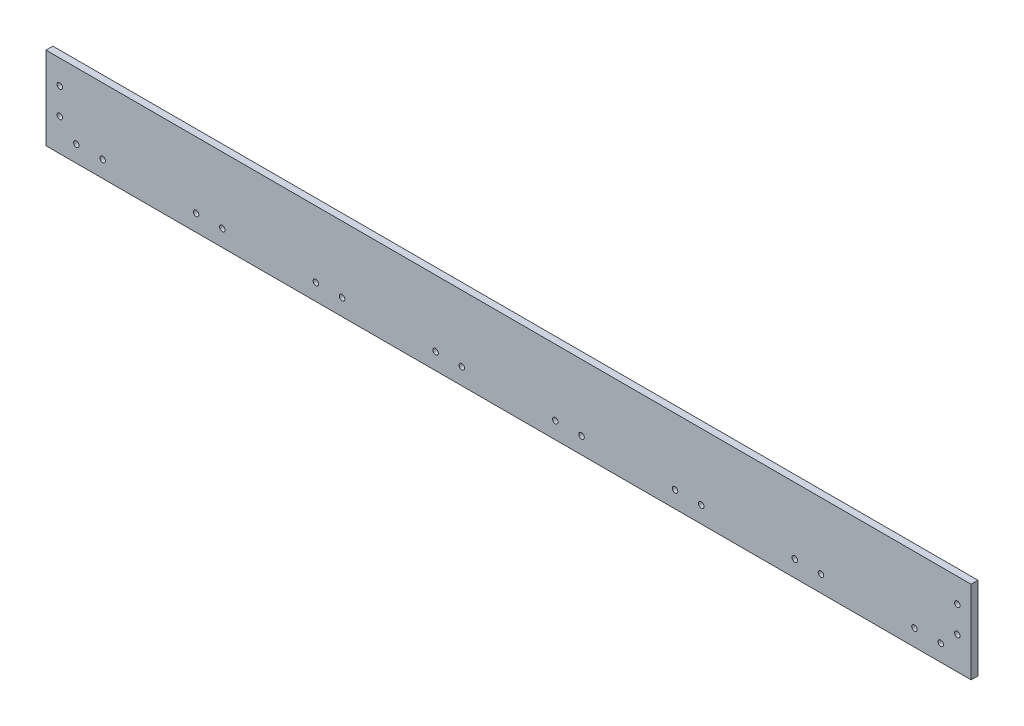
ISO-10303-21;
HEADER;
FILE_DESCRIPTION(('STEP AP214'),'2;1');
FILE_NAME('part.step','',(''),(''),'','','');
FILE_SCHEMA(('AUTOMOTIVE_DESIGN { 1 0 10303 214 1 1 1 1 }'));
ENDSEC;
DATA;
#1=APPLICATION_CONTEXT('core data for automotive mechanical design processes');
#2=APPLICATION_PROTOCOL_DEFINITION('international standard','automotive_design',2000,#1);
#3=PRODUCT_CONTEXT('',#1,'mechanical');
#4=PRODUCT('Part','Part','',(#3));
#5=PRODUCT_RELATED_PRODUCT_CATEGORY('part','',(#4));
#6=PRODUCT_DEFINITION_FORMATION('','',#4);
#7=PRODUCT_DEFINITION_CONTEXT('part definition',#1,'design');
#8=PRODUCT_DEFINITION('design','',#6,#7);
#9=PRODUCT_DEFINITION_SHAPE('','',#8);
#10=(LENGTH_UNIT() NAMED_UNIT(*) SI_UNIT(.MILLI.,.METRE.));
#11=(NAMED_UNIT(*) PLANE_ANGLE_UNIT() SI_UNIT($,.RADIAN.));
#12=(NAMED_UNIT(*) SI_UNIT($,.STERADIAN.) SOLID_ANGLE_UNIT());
#13=UNCERTAINTY_MEASURE_WITH_UNIT(LENGTH_MEASURE(1.E-05),#10,'distance_accuracy_value','');
#14=(GEOMETRIC_REPRESENTATION_CONTEXT(3) GLOBAL_UNCERTAINTY_ASSIGNED_CONTEXT((#13)) GLOBAL_UNIT_ASSIGNED_CONTEXT((#10,
#11,#12)) REPRESENTATION_CONTEXT('',''));
#15=CARTESIAN_POINT('',(0.,0.,0.));
#16=DIRECTION('',(0.,0.,1.));
#17=DIRECTION('',(1.,0.,0.));
#18=AXIS2_PLACEMENT_3D('',#15,#16,#17);
#19=CARTESIAN_POINT('',(0.,0.,6.35));
#20=DIRECTION('',(1.,0.,0.));
#21=DIRECTION('',(0.,1.,0.));
#22=AXIS2_PLACEMENT_3D('',#19,#20,#21);
#23=PLANE('',#22);
#24=DIRECTION('',(0.,-1.,0.));
#25=VECTOR('',#24,1.);
#26=CARTESIAN_POINT('',(0.,0.,0.));
#27=LINE('',#26,#25);
#28=CARTESIAN_POINT('',(0.,76.2,0.));
#29=VERTEX_POINT('',#28);
#30=CARTESIAN_POINT('',(0.,0.,0.));
#31=VERTEX_POINT('',#30);
#32=EDGE_CURVE('E98',#29,#31,#27,.T.);
#33=ORIENTED_EDGE('',*,*,#32,.T.);
#34=DIRECTION('',(0.,0.,-1.));
#35=VECTOR('',#34,1.);
#36=CARTESIAN_POINT('',(0.,0.,6.35));
#37=LINE('',#36,#35);
#38=CARTESIAN_POINT('',(0.,0.,6.35));
#39=VERTEX_POINT('',#38);
#40=EDGE_CURVE('E11',#39,#31,#37,.T.);
#41=ORIENTED_EDGE('',*,*,#40,.F.);
#42=DIRECTION('',(0.,-1.,0.));
#43=VECTOR('',#42,1.);
#44=CARTESIAN_POINT('',(0.,0.,6.35));
#45=LINE('',#44,#43);
#46=CARTESIAN_POINT('',(0.,76.2,6.35));
#47=VERTEX_POINT('',#46);
#48=EDGE_CURVE('E86',#47,#39,#45,.T.);
#49=ORIENTED_EDGE('',*,*,#48,.F.);
#50=DIRECTION('',(0.,0.,-1.));
#51=VECTOR('',#50,1.);
#52=CARTESIAN_POINT('',(0.,76.2,6.35));
#53=LINE('',#52,#51);
#54=EDGE_CURVE('E94',#47,#29,#53,.T.);
#55=ORIENTED_EDGE('',*,*,#54,.T.);
#56=EDGE_LOOP('',(#33,#41,#49,#55));
#57=FACE_BOUND('',#56,.T.);
#58=ADVANCED_FACE('F35',(#57),#23,.F.);
#59=CARTESIAN_POINT('',(0.,0.,6.35));
#60=DIRECTION('',(0.,1.,0.));
#61=DIRECTION('',(0.,0.,1.));
#62=AXIS2_PLACEMENT_3D('',#59,#60,#61);
#63=PLANE('',#62);
#64=DIRECTION('',(1.,0.,0.));
#65=VECTOR('',#64,1.);
#66=CARTESIAN_POINT('',(0.,0.,0.));
#67=LINE('',#66,#65);
#68=CARTESIAN_POINT('',(850.9,0.,0.));
#69=VERTEX_POINT('',#68);
#70=EDGE_CURVE('E90',#31,#69,#67,.T.);
#71=ORIENTED_EDGE('',*,*,#70,.T.);
#72=DIRECTION('',(0.,0.,-1.));
#73=VECTOR('',#72,1.);
#74=CARTESIAN_POINT('',(850.9,0.,6.35));
#75=LINE('',#74,#73);
#76=CARTESIAN_POINT('',(850.9,0.,6.35));
#77=VERTEX_POINT('',#76);
#78=EDGE_CURVE('E43',#77,#69,#75,.T.);
#79=ORIENTED_EDGE('',*,*,#78,.F.);
#80=DIRECTION('',(1.,0.,0.));
#81=VECTOR('',#80,1.);
#82=CARTESIAN_POINT('',(0.,0.,6.35));
#83=LINE('',#82,#81);
#84=EDGE_CURVE('E81',#39,#77,#83,.T.);
#85=ORIENTED_EDGE('',*,*,#84,.F.);
#86=ORIENTED_EDGE('',*,*,#40,.T.);
#87=EDGE_LOOP('',(#71,#79,#85,#86));
#88=FACE_BOUND('',#87,.T.);
#89=ADVANCED_FACE('F89',(#88),#63,.F.);
#90=CARTESIAN_POINT('',(850.9,0.,6.35));
#91=DIRECTION('',(-1.,0.,0.));
#92=DIRECTION('',(0.,0.,1.));
#93=AXIS2_PLACEMENT_3D('',#90,#91,#92);
#94=PLANE('',#93);
#95=DIRECTION('',(0.,1.,0.));
#96=VECTOR('',#95,1.);
#97=CARTESIAN_POINT('',(850.9,0.,0.));
#98=LINE('',#97,#96);
#99=CARTESIAN_POINT('',(850.9,76.2,0.));
#100=VERTEX_POINT('',#99);
#101=EDGE_CURVE('E68',#69,#100,#98,.T.);
#102=ORIENTED_EDGE('',*,*,#101,.T.);
#103=DIRECTION('',(0.,0.,-1.));
#104=VECTOR('',#103,1.);
#105=CARTESIAN_POINT('',(850.9,76.2,6.35));
#106=LINE('',#105,#104);
#107=CARTESIAN_POINT('',(850.9,76.2,6.35));
#108=VERTEX_POINT('',#107);
#109=EDGE_CURVE('E91',#108,#100,#106,.T.);
#110=ORIENTED_EDGE('',*,*,#109,.F.);
#111=DIRECTION('',(0.,1.,0.));
#112=VECTOR('',#111,1.);
#113=CARTESIAN_POINT('',(850.9,0.,6.35));
#114=LINE('',#113,#112);
#115=EDGE_CURVE('E84',#77,#108,#114,.T.);
#116=ORIENTED_EDGE('',*,*,#115,.F.);
#117=ORIENTED_EDGE('',*,*,#78,.T.);
#118=EDGE_LOOP('',(#102,#110,#116,#117));
#119=FACE_BOUND('',#118,.T.);
#120=ADVANCED_FACE('F92',(#119),#94,.F.);
#121=CARTESIAN_POINT('',(0.,76.2,6.35));
#122=DIRECTION('',(0.,-1.,0.));
#123=DIRECTION('',(0.,0.,-1.));
#124=AXIS2_PLACEMENT_3D('',#121,#122,#123);
#125=PLANE('',#124);
#126=DIRECTION('',(-1.,0.,0.));
#127=VECTOR('',#126,1.);
#128=CARTESIAN_POINT('',(0.,76.2,0.));
#129=LINE('',#128,#127);
#130=EDGE_CURVE('E74',#100,#29,#129,.T.);
#131=ORIENTED_EDGE('',*,*,#130,.T.);
#132=ORIENTED_EDGE('',*,*,#54,.F.);
#133=DIRECTION('',(-1.,0.,0.));
#134=VECTOR('',#133,1.);
#135=CARTESIAN_POINT('',(0.,76.2,6.35));
#136=LINE('',#135,#134);
#137=EDGE_CURVE('E51',#108,#47,#136,.T.);
#138=ORIENTED_EDGE('',*,*,#137,.F.);
#139=ORIENTED_EDGE('',*,*,#109,.T.);
#140=EDGE_LOOP('',(#131,#132,#138,#139));
#141=FACE_BOUND('',#140,.T.);
#142=ADVANCED_FACE('F106',(#141),#125,.F.);
#143=CARTESIAN_POINT('',(0.,0.,6.35));
#144=DIRECTION('',(0.,0.,-1.));
#145=DIRECTION('',(-1.,0.,0.));
#146=AXIS2_PLACEMENT_3D('',#143,#144,#145);
#147=PLANE('',#146);
#148=CARTESIAN_POINT('',(798.83,15.24,6.35));
#149=DIRECTION('',(0.,0.,1.));
#150=DIRECTION('',(1.,0.,0.));
#151=AXIS2_PLACEMENT_3D('',#148,#149,#150);
#152=CIRCLE('',#151,2.54000000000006);
#153=CARTESIAN_POINT('',(801.37,15.24,6.35));
#154=VERTEX_POINT('',#153);
#155=EDGE_CURVE('E194',#154,#154,#152,.T.);
#156=ORIENTED_EDGE('',*,*,#155,.F.);
#157=EDGE_LOOP('',(#156));
#158=FACE_BOUND('',#157,.T.);
#159=CARTESIAN_POINT('',(822.96,15.24,6.35));
#160=DIRECTION('',(0.,0.,1.));
#161=DIRECTION('',(1.,0.,0.));
#162=AXIS2_PLACEMENT_3D('',#159,#160,#161);
#163=CIRCLE('',#162,2.54000000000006);
#164=CARTESIAN_POINT('',(825.5,15.24,6.35));
#165=VERTEX_POINT('',#164);
#166=EDGE_CURVE('E193',#165,#165,#163,.T.);
#167=ORIENTED_EDGE('',*,*,#166,.F.);
#168=EDGE_LOOP('',(#167));
#169=FACE_BOUND('',#168,.T.);
#170=CARTESIAN_POINT('',(688.702857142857,15.24,6.35));
#171=DIRECTION('',(0.,0.,1.));
#172=DIRECTION('',(1.,0.,0.));
#173=AXIS2_PLACEMENT_3D('',#170,#171,#172);
#174=CIRCLE('',#173,2.54000000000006);
#175=CARTESIAN_POINT('',(691.242857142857,15.24,6.35));
#176=VERTEX_POINT('',#175);
#177=EDGE_CURVE('E200',#176,#176,#174,.T.);
#178=ORIENTED_EDGE('',*,*,#177,.F.);
#179=EDGE_LOOP('',(#178));
#180=FACE_BOUND('',#179,.T.);
#181=CARTESIAN_POINT('',(712.832857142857,15.24,6.35));
#182=DIRECTION('',(0.,0.,1.));
#183=DIRECTION('',(1.,0.,0.));
#184=AXIS2_PLACEMENT_3D('',#181,#182,#183);
#185=CIRCLE('',#184,2.54000000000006);
#186=CARTESIAN_POINT('',(715.372857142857,15.24,6.35));
#187=VERTEX_POINT('',#186);
#188=EDGE_CURVE('E206',#187,#187,#185,.T.);
#189=ORIENTED_EDGE('',*,*,#188,.F.);
#190=EDGE_LOOP('',(#189));
#191=FACE_BOUND('',#190,.T.);
#192=CARTESIAN_POINT('',(578.575714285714,15.24,6.35));
#193=DIRECTION('',(0.,0.,1.));
#194=DIRECTION('',(1.,0.,0.));
#195=AXIS2_PLACEMENT_3D('',#192,#193,#194);
#196=CIRCLE('',#195,2.54000000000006);
#197=CARTESIAN_POINT('',(581.115714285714,15.24,6.35));
#198=VERTEX_POINT('',#197);
#199=EDGE_CURVE('E212',#198,#198,#196,.T.);
#200=ORIENTED_EDGE('',*,*,#199,.F.);
#201=EDGE_LOOP('',(#200));
#202=FACE_BOUND('',#201,.T.);
#203=CARTESIAN_POINT('',(602.705714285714,15.24,6.35));
#204=DIRECTION('',(0.,0.,1.));
#205=DIRECTION('',(1.,0.,0.));
#206=AXIS2_PLACEMENT_3D('',#203,#204,#205);
#207=CIRCLE('',#206,2.54000000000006);
#208=CARTESIAN_POINT('',(605.245714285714,15.24,6.35));
#209=VERTEX_POINT('',#208);
#210=EDGE_CURVE('E218',#209,#209,#207,.T.);
#211=ORIENTED_EDGE('',*,*,#210,.F.);
#212=EDGE_LOOP('',(#211));
#213=FACE_BOUND('',#212,.T.);
#214=CARTESIAN_POINT('',(468.448571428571,15.24,6.35));
#215=DIRECTION('',(0.,0.,1.));
#216=DIRECTION('',(1.,0.,0.));
#217=AXIS2_PLACEMENT_3D('',#214,#215,#216);
#218=CIRCLE('',#217,2.54000000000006);
#219=CARTESIAN_POINT('',(470.988571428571,15.24,6.35));
#220=VERTEX_POINT('',#219);
#221=EDGE_CURVE('E224',#220,#220,#218,.T.);
#222=ORIENTED_EDGE('',*,*,#221,.F.);
#223=EDGE_LOOP('',(#222));
#224=FACE_BOUND('',#223,.T.);
#225=CARTESIAN_POINT('',(382.451428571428,15.24,6.35));
#226=DIRECTION('',(0.,0.,1.));
#227=DIRECTION('',(1.,0.,0.));
#228=AXIS2_PLACEMENT_3D('',#225,#226,#227);
#229=CIRCLE('',#228,2.54000000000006);
#230=CARTESIAN_POINT('',(384.991428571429,15.24,6.35));
#231=VERTEX_POINT('',#230);
#232=EDGE_CURVE('E158',#231,#231,#229,.T.);
#233=ORIENTED_EDGE('',*,*,#232,.F.);
#234=EDGE_LOOP('',(#233));
#235=FACE_BOUND('',#234,.T.);
#236=CARTESIAN_POINT('',(358.321428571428,15.24,6.35));
#237=DIRECTION('',(0.,0.,1.));
#238=DIRECTION('',(1.,0.,0.));
#239=AXIS2_PLACEMENT_3D('',#236,#237,#238);
#240=CIRCLE('',#239,2.54000000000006);
#241=CARTESIAN_POINT('',(360.861428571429,15.24,6.35));
#242=VERTEX_POINT('',#241);
#243=EDGE_CURVE('E165',#242,#242,#240,.T.);
#244=ORIENTED_EDGE('',*,*,#243,.F.);
#245=EDGE_LOOP('',(#244));
#246=FACE_BOUND('',#245,.T.);
#247=CARTESIAN_POINT('',(492.578571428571,15.24,6.35));
#248=DIRECTION('',(0.,0.,1.));
#249=DIRECTION('',(1.,0.,0.));
#250=AXIS2_PLACEMENT_3D('',#247,#248,#249);
#251=CIRCLE('',#250,2.54000000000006);
#252=CARTESIAN_POINT('',(495.118571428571,15.24,6.35));
#253=VERTEX_POINT('',#252);
#254=EDGE_CURVE('E166',#253,#253,#251,.T.);
#255=ORIENTED_EDGE('',*,*,#254,.F.);
#256=EDGE_LOOP('',(#255));
#257=FACE_BOUND('',#256,.T.);
#258=CARTESIAN_POINT('',(248.194285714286,15.24,6.35));
#259=DIRECTION('',(0.,0.,1.));
#260=DIRECTION('',(1.,0.,0.));
#261=AXIS2_PLACEMENT_3D('',#258,#259,#260);
#262=CIRCLE('',#261,2.54000000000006);
#263=CARTESIAN_POINT('',(250.734285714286,15.24,6.35));
#264=VERTEX_POINT('',#263);
#265=EDGE_CURVE('E157',#264,#264,#262,.T.);
#266=ORIENTED_EDGE('',*,*,#265,.F.);
#267=EDGE_LOOP('',(#266));
#268=FACE_BOUND('',#267,.T.);
#269=CARTESIAN_POINT('',(272.324285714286,15.24,6.35));
#270=DIRECTION('',(0.,0.,1.));
#271=DIRECTION('',(1.,0.,0.));
#272=AXIS2_PLACEMENT_3D('',#269,#270,#271);
#273=CIRCLE('',#272,2.54000000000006);
#274=CARTESIAN_POINT('',(274.864285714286,15.24,6.35));
#275=VERTEX_POINT('',#274);
#276=EDGE_CURVE('E177',#275,#275,#273,.T.);
#277=ORIENTED_EDGE('',*,*,#276,.F.);
#278=EDGE_LOOP('',(#277));
#279=FACE_BOUND('',#278,.T.);
#280=CARTESIAN_POINT('',(138.067142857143,15.24,6.35));
#281=DIRECTION('',(0.,0.,1.));
#282=DIRECTION('',(1.,0.,0.));
#283=AXIS2_PLACEMENT_3D('',#280,#281,#282);
#284=CIRCLE('',#283,2.54000000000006);
#285=CARTESIAN_POINT('',(140.607142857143,15.24,6.35));
#286=VERTEX_POINT('',#285);
#287=EDGE_CURVE('E183',#286,#286,#284,.T.);
#288=ORIENTED_EDGE('',*,*,#287,.F.);
#289=EDGE_LOOP('',(#288));
#290=FACE_BOUND('',#289,.T.);
#291=CARTESIAN_POINT('',(162.197142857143,15.24,6.35));
#292=DIRECTION('',(0.,0.,1.));
#293=DIRECTION('',(1.,0.,0.));
#294=AXIS2_PLACEMENT_3D('',#291,#292,#293);
#295=CIRCLE('',#294,2.54000000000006);
#296=CARTESIAN_POINT('',(164.737142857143,15.24,6.35));
#297=VERTEX_POINT('',#296);
#298=EDGE_CURVE('E150',#297,#297,#295,.T.);
#299=ORIENTED_EDGE('',*,*,#298,.F.);
#300=EDGE_LOOP('',(#299));
#301=FACE_BOUND('',#300,.T.);
#302=CARTESIAN_POINT('',(12.7,53.975,6.35));
#303=DIRECTION('',(0.,0.,1.));
#304=DIRECTION('',(1.,0.,0.));
#305=AXIS2_PLACEMENT_3D('',#302,#303,#304);
#306=CIRCLE('',#305,2.54);
#307=CARTESIAN_POINT('',(15.24,53.975,6.35));
#308=VERTEX_POINT('',#307);
#309=EDGE_CURVE('E141',#308,#308,#306,.T.);
#310=ORIENTED_EDGE('',*,*,#309,.F.);
#311=EDGE_LOOP('',(#310));
#312=FACE_BOUND('',#311,.T.);
#313=CARTESIAN_POINT('',(838.2,29.8450000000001,6.35));
#314=DIRECTION('',(0.,0.,1.));
#315=DIRECTION('',(-1.,0.,0.));
#316=AXIS2_PLACEMENT_3D('',#313,#314,#315);
#317=CIRCLE('',#316,2.54000000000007);
#318=CARTESIAN_POINT('',(840.74,29.8450000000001,6.35));
#319=VERTEX_POINT('',#318);
#320=EDGE_CURVE('E133',#319,#319,#317,.T.);
#321=ORIENTED_EDGE('',*,*,#320,.F.);
#322=EDGE_LOOP('',(#321));
#323=FACE_BOUND('',#322,.T.);
#324=CARTESIAN_POINT('',(838.2,53.9750000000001,6.35));
#325=DIRECTION('',(0.,0.,1.));
#326=DIRECTION('',(-1.,0.,0.));
#327=AXIS2_PLACEMENT_3D('',#324,#325,#326);
#328=CIRCLE('',#327,2.54000000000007);
#329=CARTESIAN_POINT('',(840.74,53.9750000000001,6.35));
#330=VERTEX_POINT('',#329);
#331=EDGE_CURVE('E134',#330,#330,#328,.T.);
#332=ORIENTED_EDGE('',*,*,#331,.F.);
#333=EDGE_LOOP('',(#332));
#334=FACE_BOUND('',#333,.T.);
#335=CARTESIAN_POINT('',(12.7,29.845,6.35));
#336=DIRECTION('',(0.,0.,1.));
#337=DIRECTION('',(1.,0.,0.));
#338=AXIS2_PLACEMENT_3D('',#335,#336,#337);
#339=CIRCLE('',#338,2.54);
#340=CARTESIAN_POINT('',(15.24,29.845,6.35));
#341=VERTEX_POINT('',#340);
#342=EDGE_CURVE('E126',#341,#341,#339,.T.);
#343=ORIENTED_EDGE('',*,*,#342,.F.);
#344=EDGE_LOOP('',(#343));
#345=FACE_BOUND('',#344,.T.);
#346=CARTESIAN_POINT('',(27.94,15.24,6.35));
#347=DIRECTION('',(0.,0.,1.));
#348=DIRECTION('',(1.,0.,0.));
#349=AXIS2_PLACEMENT_3D('',#346,#347,#348);
#350=CIRCLE('',#349,2.54000000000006);
#351=CARTESIAN_POINT('',(30.48,15.24,6.35));
#352=VERTEX_POINT('',#351);
#353=EDGE_CURVE('E117',#352,#352,#350,.T.);
#354=ORIENTED_EDGE('',*,*,#353,.F.);
#355=EDGE_LOOP('',(#354));
#356=FACE_BOUND('',#355,.T.);
#357=CARTESIAN_POINT('',(52.07,15.24,6.35));
#358=DIRECTION('',(0.,0.,1.));
#359=DIRECTION('',(1.,0.,0.));
#360=AXIS2_PLACEMENT_3D('',#357,#358,#359);
#361=CIRCLE('',#360,2.54000000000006);
#362=CARTESIAN_POINT('',(54.6100000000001,15.24,6.35));
#363=VERTEX_POINT('',#362);
#364=EDGE_CURVE('E114',#363,#363,#361,.T.);
#365=ORIENTED_EDGE('',*,*,#364,.F.);
#366=EDGE_LOOP('',(#365));
#367=FACE_BOUND('',#366,.T.);
#368=ORIENTED_EDGE('',*,*,#48,.T.);
#369=ORIENTED_EDGE('',*,*,#84,.T.);
#370=ORIENTED_EDGE('',*,*,#115,.T.);
#371=ORIENTED_EDGE('',*,*,#137,.T.);
#372=EDGE_LOOP('',(#368,#369,#370,#371));
#373=FACE_BOUND('',#372,.T.);
#374=ADVANCED_FACE('F82',(#158,#169,#180,#191,#202,#213,#224,#235,#246,#257,#268,#279,#290,#301,
#312,#323,#334,#345,#356,#367,#373),#147,.F.);
#375=CARTESIAN_POINT('',(0.,0.,0.));
#376=DIRECTION('',(0.,0.,-1.));
#377=DIRECTION('',(-1.,0.,0.));
#378=AXIS2_PLACEMENT_3D('',#375,#376,#377);
#379=PLANE('',#378);
#380=CARTESIAN_POINT('',(798.83,15.24,0.));
#381=DIRECTION('',(0.,0.,-1.));
#382=DIRECTION('',(-1.,0.,0.));
#383=AXIS2_PLACEMENT_3D('',#380,#381,#382);
#384=CIRCLE('',#383,2.54000000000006);
#385=CARTESIAN_POINT('',(796.29,15.24,0.));
#386=VERTEX_POINT('',#385);
#387=EDGE_CURVE('E190',#386,#386,#384,.F.);
#388=ORIENTED_EDGE('',*,*,#387,.T.);
#389=EDGE_LOOP('',(#388));
#390=FACE_BOUND('',#389,.T.);
#391=CARTESIAN_POINT('',(822.96,15.24,0.));
#392=DIRECTION('',(0.,0.,-1.));
#393=DIRECTION('',(-1.,0.,0.));
#394=AXIS2_PLACEMENT_3D('',#391,#392,#393);
#395=CIRCLE('',#394,2.54000000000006);
#396=CARTESIAN_POINT('',(820.42,15.24,0.));
#397=VERTEX_POINT('',#396);
#398=EDGE_CURVE('E197',#397,#397,#395,.F.);
#399=ORIENTED_EDGE('',*,*,#398,.T.);
#400=EDGE_LOOP('',(#399));
#401=FACE_BOUND('',#400,.T.);
#402=CARTESIAN_POINT('',(688.702857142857,15.24,0.));
#403=DIRECTION('',(0.,0.,-1.));
#404=DIRECTION('',(-1.,0.,0.));
#405=AXIS2_PLACEMENT_3D('',#402,#403,#404);
#406=CIRCLE('',#405,2.54000000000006);
#407=CARTESIAN_POINT('',(686.162857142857,15.24,0.));
#408=VERTEX_POINT('',#407);
#409=EDGE_CURVE('E203',#408,#408,#406,.F.);
#410=ORIENTED_EDGE('',*,*,#409,.T.);
#411=EDGE_LOOP('',(#410));
#412=FACE_BOUND('',#411,.T.);
#413=CARTESIAN_POINT('',(712.832857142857,15.24,0.));
#414=DIRECTION('',(0.,0.,-1.));
#415=DIRECTION('',(-1.,0.,0.));
#416=AXIS2_PLACEMENT_3D('',#413,#414,#415);
#417=CIRCLE('',#416,2.54000000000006);
#418=CARTESIAN_POINT('',(710.292857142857,15.24,0.));
#419=VERTEX_POINT('',#418);
#420=EDGE_CURVE('E209',#419,#419,#417,.F.);
#421=ORIENTED_EDGE('',*,*,#420,.T.);
#422=EDGE_LOOP('',(#421));
#423=FACE_BOUND('',#422,.T.);
#424=CARTESIAN_POINT('',(578.575714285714,15.24,0.));
#425=DIRECTION('',(0.,0.,-1.));
#426=DIRECTION('',(-1.,0.,0.));
#427=AXIS2_PLACEMENT_3D('',#424,#425,#426);
#428=CIRCLE('',#427,2.54000000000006);
#429=CARTESIAN_POINT('',(576.035714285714,15.24,0.));
#430=VERTEX_POINT('',#429);
#431=EDGE_CURVE('E215',#430,#430,#428,.F.);
#432=ORIENTED_EDGE('',*,*,#431,.T.);
#433=EDGE_LOOP('',(#432));
#434=FACE_BOUND('',#433,.T.);
#435=CARTESIAN_POINT('',(602.705714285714,15.24,0.));
#436=DIRECTION('',(0.,0.,-1.));
#437=DIRECTION('',(-1.,0.,0.));
#438=AXIS2_PLACEMENT_3D('',#435,#436,#437);
#439=CIRCLE('',#438,2.54000000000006);
#440=CARTESIAN_POINT('',(600.165714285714,15.24,0.));
#441=VERTEX_POINT('',#440);
#442=EDGE_CURVE('E221',#441,#441,#439,.F.);
#443=ORIENTED_EDGE('',*,*,#442,.T.);
#444=EDGE_LOOP('',(#443));
#445=FACE_BOUND('',#444,.T.);
#446=CARTESIAN_POINT('',(468.448571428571,15.24,0.));
#447=DIRECTION('',(0.,0.,-1.));
#448=DIRECTION('',(-1.,0.,0.));
#449=AXIS2_PLACEMENT_3D('',#446,#447,#448);
#450=CIRCLE('',#449,2.54000000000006);
#451=CARTESIAN_POINT('',(470.988571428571,15.24,0.));
#452=VERTEX_POINT('',#451);
#453=EDGE_CURVE('E169',#452,#452,#450,.F.);
#454=ORIENTED_EDGE('',*,*,#453,.T.);
#455=EDGE_LOOP('',(#454));
#456=FACE_BOUND('',#455,.T.);
#457=CARTESIAN_POINT('',(382.451428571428,15.24,0.));
#458=DIRECTION('',(0.,0.,-1.));
#459=DIRECTION('',(-1.,0.,0.));
#460=AXIS2_PLACEMENT_3D('',#457,#458,#459);
#461=CIRCLE('',#460,2.54000000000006);
#462=CARTESIAN_POINT('',(384.991428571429,15.24,0.));
#463=VERTEX_POINT('',#462);
#464=EDGE_CURVE('E154',#463,#463,#461,.F.);
#465=ORIENTED_EDGE('',*,*,#464,.T.);
#466=EDGE_LOOP('',(#465));
#467=FACE_BOUND('',#466,.T.);
#468=CARTESIAN_POINT('',(358.321428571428,15.24,0.));
#469=DIRECTION('',(0.,0.,-1.));
#470=DIRECTION('',(-1.,0.,0.));
#471=AXIS2_PLACEMENT_3D('',#468,#469,#470);
#472=CIRCLE('',#471,2.54000000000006);
#473=CARTESIAN_POINT('',(360.861428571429,15.24,0.));
#474=VERTEX_POINT('',#473);
#475=EDGE_CURVE('E161',#474,#474,#472,.F.);
#476=ORIENTED_EDGE('',*,*,#475,.T.);
#477=EDGE_LOOP('',(#476));
#478=FACE_BOUND('',#477,.T.);
#479=CARTESIAN_POINT('',(492.578571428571,15.24,0.));
#480=DIRECTION('',(0.,0.,-1.));
#481=DIRECTION('',(-1.,0.,0.));
#482=AXIS2_PLACEMENT_3D('',#479,#480,#481);
#483=CIRCLE('',#482,2.54000000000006);
#484=CARTESIAN_POINT('',(495.118571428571,15.24,0.));
#485=VERTEX_POINT('',#484);
#486=EDGE_CURVE('E162',#485,#485,#483,.F.);
#487=ORIENTED_EDGE('',*,*,#486,.T.);
#488=EDGE_LOOP('',(#487));
#489=FACE_BOUND('',#488,.T.);
#490=CARTESIAN_POINT('',(248.194285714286,15.24,0.));
#491=DIRECTION('',(0.,0.,-1.));
#492=DIRECTION('',(-1.,0.,0.));
#493=AXIS2_PLACEMENT_3D('',#490,#491,#492);
#494=CIRCLE('',#493,2.54000000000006);
#495=CARTESIAN_POINT('',(245.654285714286,15.24,0.));
#496=VERTEX_POINT('',#495);
#497=EDGE_CURVE('E174',#496,#496,#494,.F.);
#498=ORIENTED_EDGE('',*,*,#497,.T.);
#499=EDGE_LOOP('',(#498));
#500=FACE_BOUND('',#499,.T.);
#501=CARTESIAN_POINT('',(272.324285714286,15.24,0.));
#502=DIRECTION('',(0.,0.,-1.));
#503=DIRECTION('',(-1.,0.,0.));
#504=AXIS2_PLACEMENT_3D('',#501,#502,#503);
#505=CIRCLE('',#504,2.54000000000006);
#506=CARTESIAN_POINT('',(269.784285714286,15.24,0.));
#507=VERTEX_POINT('',#506);
#508=EDGE_CURVE('E180',#507,#507,#505,.F.);
#509=ORIENTED_EDGE('',*,*,#508,.T.);
#510=EDGE_LOOP('',(#509));
#511=FACE_BOUND('',#510,.T.);
#512=CARTESIAN_POINT('',(138.067142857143,15.24,0.));
#513=DIRECTION('',(0.,0.,-1.));
#514=DIRECTION('',(-1.,0.,0.));
#515=AXIS2_PLACEMENT_3D('',#512,#513,#514);
#516=CIRCLE('',#515,2.54000000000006);
#517=CARTESIAN_POINT('',(135.527142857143,15.24,0.));
#518=VERTEX_POINT('',#517);
#519=EDGE_CURVE('E153',#518,#518,#516,.F.);
#520=ORIENTED_EDGE('',*,*,#519,.T.);
#521=EDGE_LOOP('',(#520));
#522=FACE_BOUND('',#521,.T.);
#523=CARTESIAN_POINT('',(162.197142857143,15.24,0.));
#524=DIRECTION('',(0.,0.,-1.));
#525=DIRECTION('',(-1.,0.,0.));
#526=AXIS2_PLACEMENT_3D('',#523,#524,#525);
#527=CIRCLE('',#526,2.54000000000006);
#528=CARTESIAN_POINT('',(159.657142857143,15.24,0.));
#529=VERTEX_POINT('',#528);
#530=EDGE_CURVE('E137',#529,#529,#527,.F.);
#531=ORIENTED_EDGE('',*,*,#530,.T.);
#532=EDGE_LOOP('',(#531));
#533=FACE_BOUND('',#532,.T.);
#534=CARTESIAN_POINT('',(12.7,53.975,0.));
#535=DIRECTION('',(0.,0.,-1.));
#536=DIRECTION('',(-1.,0.,0.));
#537=AXIS2_PLACEMENT_3D('',#534,#535,#536);
#538=CIRCLE('',#537,2.54);
#539=CARTESIAN_POINT('',(15.24,53.975,0.));
#540=VERTEX_POINT('',#539);
#541=EDGE_CURVE('E129',#540,#540,#538,.F.);
#542=ORIENTED_EDGE('',*,*,#541,.T.);
#543=EDGE_LOOP('',(#542));
#544=FACE_BOUND('',#543,.T.);
#545=CARTESIAN_POINT('',(838.2,29.8450000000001,0.));
#546=DIRECTION('',(0.,0.,-1.));
#547=DIRECTION('',(-1.,0.,0.));
#548=AXIS2_PLACEMENT_3D('',#545,#546,#547);
#549=CIRCLE('',#548,2.54000000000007);
#550=CARTESIAN_POINT('',(840.74,29.8450000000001,0.));
#551=VERTEX_POINT('',#550);
#552=EDGE_CURVE('E138',#551,#551,#549,.F.);
#553=ORIENTED_EDGE('',*,*,#552,.T.);
#554=EDGE_LOOP('',(#553));
#555=FACE_BOUND('',#554,.T.);
#556=CARTESIAN_POINT('',(838.2,53.9750000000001,0.));
#557=DIRECTION('',(0.,0.,-1.));
#558=DIRECTION('',(-1.,0.,0.));
#559=AXIS2_PLACEMENT_3D('',#556,#557,#558);
#560=CIRCLE('',#559,2.54000000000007);
#561=CARTESIAN_POINT('',(840.74,53.9750000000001,0.));
#562=VERTEX_POINT('',#561);
#563=EDGE_CURVE('E130',#562,#562,#560,.F.);
#564=ORIENTED_EDGE('',*,*,#563,.T.);
#565=EDGE_LOOP('',(#564));
#566=FACE_BOUND('',#565,.T.);
#567=CARTESIAN_POINT('',(12.7,29.845,0.));
#568=DIRECTION('',(0.,0.,-1.));
#569=DIRECTION('',(-1.,0.,0.));
#570=AXIS2_PLACEMENT_3D('',#567,#568,#569);
#571=CIRCLE('',#570,2.54);
#572=CARTESIAN_POINT('',(15.24,29.845,0.));
#573=VERTEX_POINT('',#572);
#574=EDGE_CURVE('E123',#573,#573,#571,.F.);
#575=ORIENTED_EDGE('',*,*,#574,.T.);
#576=EDGE_LOOP('',(#575));
#577=FACE_BOUND('',#576,.T.);
#578=CARTESIAN_POINT('',(27.94,15.24,0.));
#579=DIRECTION('',(0.,0.,-1.));
#580=DIRECTION('',(-1.,0.,0.));
#581=AXIS2_PLACEMENT_3D('',#578,#579,#580);
#582=CIRCLE('',#581,2.54000000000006);
#583=CARTESIAN_POINT('',(25.3999999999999,15.24,0.));
#584=VERTEX_POINT('',#583);
#585=EDGE_CURVE('E120',#584,#584,#582,.F.);
#586=ORIENTED_EDGE('',*,*,#585,.T.);
#587=EDGE_LOOP('',(#586));
#588=FACE_BOUND('',#587,.T.);
#589=CARTESIAN_POINT('',(52.07,15.24,0.));
#590=DIRECTION('',(0.,0.,-1.));
#591=DIRECTION('',(-1.,0.,0.));
#592=AXIS2_PLACEMENT_3D('',#589,#590,#591);
#593=CIRCLE('',#592,2.54000000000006);
#594=CARTESIAN_POINT('',(49.5299999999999,15.24,0.));
#595=VERTEX_POINT('',#594);
#596=EDGE_CURVE('E101',#595,#595,#593,.F.);
#597=ORIENTED_EDGE('',*,*,#596,.T.);
#598=EDGE_LOOP('',(#597));
#599=FACE_BOUND('',#598,.T.);
#600=ORIENTED_EDGE('',*,*,#32,.F.);
#601=ORIENTED_EDGE('',*,*,#130,.F.);
#602=ORIENTED_EDGE('',*,*,#101,.F.);
#603=ORIENTED_EDGE('',*,*,#70,.F.);
#604=EDGE_LOOP('',(#600,#601,#602,#603));
#605=FACE_BOUND('',#604,.T.);
#606=ADVANCED_FACE('F109',(#390,#401,#412,#423,#434,#445,#456,#467,#478,#489,#500,#511,#522,
#533,#544,#555,#566,#577,#588,#599,#605),#379,.T.);
#607=CARTESIAN_POINT('',(52.07,15.24,-7.1842048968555));
#608=DIRECTION('',(0.,0.,1.));
#609=DIRECTION('',(1.,0.,0.));
#610=AXIS2_PLACEMENT_3D('',#607,#608,#609);
#611=CYLINDRICAL_SURFACE('',#610,2.54000000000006);
#612=ORIENTED_EDGE('',*,*,#364,.T.);
#613=EDGE_LOOP('',(#612));
#614=FACE_BOUND('',#613,.T.);
#615=ORIENTED_EDGE('',*,*,#596,.F.);
#616=EDGE_LOOP('',(#615));
#617=FACE_BOUND('',#616,.T.);
#618=ADVANCED_FACE('F265',(#614,#617),#611,.F.);
#619=CARTESIAN_POINT('',(27.94,15.24,-7.1842048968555));
#620=DIRECTION('',(0.,0.,1.));
#621=DIRECTION('',(1.,0.,0.));
#622=AXIS2_PLACEMENT_3D('',#619,#620,#621);
#623=CYLINDRICAL_SURFACE('',#622,2.54000000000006);
#624=ORIENTED_EDGE('',*,*,#353,.T.);
#625=EDGE_LOOP('',(#624));
#626=FACE_BOUND('',#625,.T.);
#627=ORIENTED_EDGE('',*,*,#585,.F.);
#628=EDGE_LOOP('',(#627));
#629=FACE_BOUND('',#628,.T.);
#630=ADVANCED_FACE('F268',(#626,#629),#623,.F.);
#631=CARTESIAN_POINT('',(12.7,29.845,-7.18420489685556));
#632=DIRECTION('',(0.,0.,1.));
#633=DIRECTION('',(1.,0.,0.));
#634=AXIS2_PLACEMENT_3D('',#631,#632,#633);
#635=CYLINDRICAL_SURFACE('',#634,2.54);
#636=CARTESIAN_POINT('',(15.24,29.845,6.35));
#637=CARTESIAN_POINT('',(15.24,29.845,6.28385416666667));
#638=CARTESIAN_POINT('',(15.24,29.845,6.21770833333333));
#639=CARTESIAN_POINT('',(15.24,29.845,6.08541666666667));
#640=CARTESIAN_POINT('',(15.24,29.845,6.01927083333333));
#641=CARTESIAN_POINT('',(15.24,29.845,5.88697916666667));
#642=CARTESIAN_POINT('',(15.24,29.845,5.82083333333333));
#643=CARTESIAN_POINT('',(15.24,29.845,5.68854166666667));
#644=CARTESIAN_POINT('',(15.24,29.845,5.62239583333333));
#645=CARTESIAN_POINT('',(15.24,29.845,5.49010416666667));
#646=CARTESIAN_POINT('',(15.24,29.845,5.42395833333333));
#647=CARTESIAN_POINT('',(15.24,29.845,5.29166666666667));
#648=CARTESIAN_POINT('',(15.24,29.845,5.22552083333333));
#649=CARTESIAN_POINT('',(15.24,29.845,5.09322916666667));
#650=CARTESIAN_POINT('',(15.24,29.845,5.02708333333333));
#651=CARTESIAN_POINT('',(15.24,29.845,4.89479166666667));
#652=CARTESIAN_POINT('',(15.24,29.845,4.82864583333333));
#653=CARTESIAN_POINT('',(15.24,29.845,4.69635416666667));
#654=CARTESIAN_POINT('',(15.24,29.845,4.63020833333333));
#655=CARTESIAN_POINT('',(15.24,29.845,4.49791666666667));
#656=CARTESIAN_POINT('',(15.24,29.845,4.43177083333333));
#657=CARTESIAN_POINT('',(15.24,29.845,4.29947916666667));
#658=CARTESIAN_POINT('',(15.24,29.845,4.23333333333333));
#659=CARTESIAN_POINT('',(15.24,29.845,4.10104166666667));
#660=CARTESIAN_POINT('',(15.24,29.845,4.03489583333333));
#661=CARTESIAN_POINT('',(15.24,29.845,3.90260416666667));
#662=CARTESIAN_POINT('',(15.24,29.845,3.83645833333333));
#663=CARTESIAN_POINT('',(15.24,29.845,3.70416666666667));
#664=CARTESIAN_POINT('',(15.24,29.845,3.63802083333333));
#665=CARTESIAN_POINT('',(15.24,29.845,3.50572916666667));
#666=CARTESIAN_POINT('',(15.24,29.845,3.43958333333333));
#667=CARTESIAN_POINT('',(15.24,29.845,3.30729166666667));
#668=CARTESIAN_POINT('',(15.24,29.845,3.24114583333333));
#669=CARTESIAN_POINT('',(15.24,29.845,3.10885416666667));
#670=CARTESIAN_POINT('',(15.24,29.845,3.04270833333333));
#671=CARTESIAN_POINT('',(15.24,29.845,2.91041666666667));
#672=CARTESIAN_POINT('',(15.24,29.845,2.84427083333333));
#673=CARTESIAN_POINT('',(15.24,29.845,2.71197916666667));
#674=CARTESIAN_POINT('',(15.24,29.845,2.64583333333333));
#675=CARTESIAN_POINT('',(15.24,29.845,2.51354166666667));
#676=CARTESIAN_POINT('',(15.24,29.845,2.44739583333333));
#677=CARTESIAN_POINT('',(15.24,29.845,2.31510416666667));
#678=CARTESIAN_POINT('',(15.24,29.845,2.24895833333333));
#679=CARTESIAN_POINT('',(15.24,29.845,2.11666666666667));
#680=CARTESIAN_POINT('',(15.24,29.845,2.05052083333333));
#681=CARTESIAN_POINT('',(15.24,29.845,1.91822916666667));
#682=CARTESIAN_POINT('',(15.24,29.845,1.85208333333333));
#683=CARTESIAN_POINT('',(15.24,29.845,1.71979166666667));
#684=CARTESIAN_POINT('',(15.24,29.845,1.65364583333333));
#685=CARTESIAN_POINT('',(15.24,29.845,1.52135416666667));
#686=CARTESIAN_POINT('',(15.24,29.845,1.45520833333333));
#687=CARTESIAN_POINT('',(15.24,29.845,1.32291666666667));
#688=CARTESIAN_POINT('',(15.24,29.845,1.25677083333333));
#689=CARTESIAN_POINT('',(15.24,29.845,1.12447916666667));
#690=CARTESIAN_POINT('',(15.24,29.845,1.05833333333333));
#691=CARTESIAN_POINT('',(15.24,29.845,0.926041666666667));
#692=CARTESIAN_POINT('',(15.24,29.845,0.859895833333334));
#693=CARTESIAN_POINT('',(15.24,29.845,0.727604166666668));
#694=CARTESIAN_POINT('',(15.24,29.845,0.661458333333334));
#695=CARTESIAN_POINT('',(15.24,29.845,0.529166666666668));
#696=CARTESIAN_POINT('',(15.24,29.845,0.463020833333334));
#697=CARTESIAN_POINT('',(15.24,29.845,0.330729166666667));
#698=CARTESIAN_POINT('',(15.24,29.845,0.264583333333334));
#699=CARTESIAN_POINT('',(15.24,29.845,0.132291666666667));
#700=CARTESIAN_POINT('',(15.24,29.845,0.0661458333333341));
#701=CARTESIAN_POINT('',(15.24,29.845,0.));
#702=B_SPLINE_CURVE_WITH_KNOTS('',3,(#636,#637,#638,#639,#640,#641,#642,#643,#644,#645,#646,
#647,#648,#649,#650,#651,#652,#653,#654,#655,#656,#657,#658,#659,#660,#661,#662,#663,#664,#665,
#666,#667,#668,#669,#670,#671,#672,#673,#674,#675,#676,#677,#678,#679,#680,#681,#682,#683,#684,
#685,#686,#687,#688,#689,#690,#691,#692,#693,#694,#695,#696,#697,#698,#699,#700,#701),
.UNSPECIFIED.,.F.,.F.,(4,2,2,2,2,2,2,2,2,2,2,2,2,2,2,2,2,2,2,2,2,2,2,2,2,2,2,2,2,2,2,2,4),(0.,
0.198437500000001,0.396875,0.5953125,0.793749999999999,0.9921875,1.190625,1.3890625,1.5875,
1.7859375,1.984375,2.1828125,2.38125,2.5796875,2.778125,2.9765625,3.175,3.3734375,3.571875,
3.7703125,3.96875,4.1671875,4.365625,4.5640625,4.7625,4.9609375,5.159375,5.3578125,5.55625,
5.7546875,5.953125,6.1515625,6.35),.UNSPECIFIED.);
#703=EDGE_CURVE('BSEAM461',#341,#573,#702,.T.);
#704=ORIENTED_EDGE('',*,*,#342,.T.);
#705=ORIENTED_EDGE('',*,*,#574,.F.);
#706=ORIENTED_EDGE('',*,*,#703,.T.);
#707=ORIENTED_EDGE('',*,*,#703,.F.);
#708=EDGE_LOOP('',(#704,#706,#705,#707));
#709=FACE_BOUND('',#708,.T.);
#710=ADVANCED_FACE('F461',(#709),#635,.F.);
#711=CARTESIAN_POINT('',(838.2,53.9750000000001,-7.18420489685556));
#712=DIRECTION('',(0.,0.,1.));
#713=DIRECTION('',(1.,0.,0.));
#714=AXIS2_PLACEMENT_3D('',#711,#712,#713);
#715=CYLINDRICAL_SURFACE('',#714,2.54000000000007);
#716=CARTESIAN_POINT('',(840.74,53.9750000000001,6.35));
#717=CARTESIAN_POINT('',(840.74,53.9750000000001,6.28385416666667));
#718=CARTESIAN_POINT('',(840.74,53.9750000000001,6.21770833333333));
#719=CARTESIAN_POINT('',(840.74,53.9750000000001,6.08541666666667));
#720=CARTESIAN_POINT('',(840.74,53.9750000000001,6.01927083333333));
#721=CARTESIAN_POINT('',(840.74,53.9750000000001,5.88697916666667));
#722=CARTESIAN_POINT('',(840.74,53.9750000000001,5.82083333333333));
#723=CARTESIAN_POINT('',(840.74,53.9750000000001,5.68854166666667));
#724=CARTESIAN_POINT('',(840.74,53.9750000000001,5.62239583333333));
#725=CARTESIAN_POINT('',(840.74,53.9750000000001,5.49010416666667));
#726=CARTESIAN_POINT('',(840.74,53.9750000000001,5.42395833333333));
#727=CARTESIAN_POINT('',(840.74,53.9750000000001,5.29166666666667));
#728=CARTESIAN_POINT('',(840.74,53.9750000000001,5.22552083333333));
#729=CARTESIAN_POINT('',(840.74,53.9750000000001,5.09322916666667));
#730=CARTESIAN_POINT('',(840.74,53.9750000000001,5.02708333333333));
#731=CARTESIAN_POINT('',(840.74,53.9750000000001,4.89479166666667));
#732=CARTESIAN_POINT('',(840.74,53.9750000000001,4.82864583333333));
#733=CARTESIAN_POINT('',(840.74,53.9750000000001,4.69635416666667));
#734=CARTESIAN_POINT('',(840.74,53.9750000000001,4.63020833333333));
#735=CARTESIAN_POINT('',(840.74,53.9750000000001,4.49791666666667));
#736=CARTESIAN_POINT('',(840.74,53.9750000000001,4.43177083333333));
#737=CARTESIAN_POINT('',(840.74,53.9750000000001,4.29947916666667));
#738=CARTESIAN_POINT('',(840.74,53.9750000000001,4.23333333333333));
#739=CARTESIAN_POINT('',(840.74,53.9750000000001,4.10104166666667));
#740=CARTESIAN_POINT('',(840.74,53.9750000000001,4.03489583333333));
#741=CARTESIAN_POINT('',(840.74,53.9750000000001,3.90260416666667));
#742=CARTESIAN_POINT('',(840.74,53.9750000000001,3.83645833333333));
#743=CARTESIAN_POINT('',(840.74,53.9750000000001,3.70416666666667));
#744=CARTESIAN_POINT('',(840.74,53.9750000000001,3.63802083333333));
#745=CARTESIAN_POINT('',(840.74,53.9750000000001,3.50572916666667));
#746=CARTESIAN_POINT('',(840.74,53.9750000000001,3.43958333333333));
#747=CARTESIAN_POINT('',(840.74,53.9750000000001,3.30729166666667));
#748=CARTESIAN_POINT('',(840.74,53.9750000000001,3.24114583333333));
#749=CARTESIAN_POINT('',(840.74,53.9750000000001,3.10885416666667));
#750=CARTESIAN_POINT('',(840.74,53.9750000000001,3.04270833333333));
#751=CARTESIAN_POINT('',(840.74,53.9750000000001,2.91041666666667));
#752=CARTESIAN_POINT('',(840.74,53.9750000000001,2.84427083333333));
#753=CARTESIAN_POINT('',(840.74,53.9750000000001,2.71197916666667));
#754=CARTESIAN_POINT('',(840.74,53.9750000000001,2.64583333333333));
#755=CARTESIAN_POINT('',(840.74,53.9750000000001,2.51354166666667));
#756=CARTESIAN_POINT('',(840.74,53.9750000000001,2.44739583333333));
#757=CARTESIAN_POINT('',(840.74,53.9750000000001,2.31510416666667));
#758=CARTESIAN_POINT('',(840.74,53.9750000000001,2.24895833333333));
#759=CARTESIAN_POINT('',(840.74,53.9750000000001,2.11666666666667));
#760=CARTESIAN_POINT('',(840.74,53.9750000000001,2.05052083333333));
#761=CARTESIAN_POINT('',(840.74,53.9750000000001,1.91822916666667));
#762=CARTESIAN_POINT('',(840.74,53.9750000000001,1.85208333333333));
#763=CARTESIAN_POINT('',(840.74,53.9750000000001,1.71979166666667));
#764=CARTESIAN_POINT('',(840.74,53.9750000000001,1.65364583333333));
#765=CARTESIAN_POINT('',(840.74,53.9750000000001,1.52135416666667));
#766=CARTESIAN_POINT('',(840.74,53.9750000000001,1.45520833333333));
#767=CARTESIAN_POINT('',(840.74,53.9750000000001,1.32291666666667));
#768=CARTESIAN_POINT('',(840.74,53.9750000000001,1.25677083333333));
#769=CARTESIAN_POINT('',(840.74,53.9750000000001,1.12447916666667));
#770=CARTESIAN_POINT('',(840.74,53.9750000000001,1.05833333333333));
#771=CARTESIAN_POINT('',(840.74,53.9750000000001,0.926041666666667));
#772=CARTESIAN_POINT('',(840.74,53.9750000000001,0.859895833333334));
#773=CARTESIAN_POINT('',(840.74,53.9750000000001,0.727604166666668));
#774=CARTESIAN_POINT('',(840.74,53.9750000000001,0.661458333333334));
#775=CARTESIAN_POINT('',(840.74,53.9750000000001,0.529166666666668));
#776=CARTESIAN_POINT('',(840.74,53.9750000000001,0.463020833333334));
#777=CARTESIAN_POINT('',(840.74,53.9750000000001,0.330729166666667));
#778=CARTESIAN_POINT('',(840.74,53.9750000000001,0.264583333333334));
#779=CARTESIAN_POINT('',(840.74,53.9750000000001,0.132291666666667));
#780=CARTESIAN_POINT('',(840.74,53.9750000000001,0.0661458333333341));
#781=CARTESIAN_POINT('',(840.74,53.9750000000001,0.));
#782=B_SPLINE_CURVE_WITH_KNOTS('',3,(#716,#717,#718,#719,#720,#721,#722,#723,#724,#725,#726,
#727,#728,#729,#730,#731,#732,#733,#734,#735,#736,#737,#738,#739,#740,#741,#742,#743,#744,#745,
#746,#747,#748,#749,#750,#751,#752,#753,#754,#755,#756,#757,#758,#759,#760,#761,#762,#763,#764,
#765,#766,#767,#768,#769,#770,#771,#772,#773,#774,#775,#776,#777,#778,#779,#780,#781),
.UNSPECIFIED.,.F.,.F.,(4,2,2,2,2,2,2,2,2,2,2,2,2,2,2,2,2,2,2,2,2,2,2,2,2,2,2,2,2,2,2,2,4),(0.,
0.198437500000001,0.396875,0.5953125,0.793749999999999,0.9921875,1.190625,1.3890625,1.5875,
1.7859375,1.984375,2.1828125,2.38125,2.5796875,2.778125,2.9765625,3.175,3.3734375,3.571875,
3.7703125,3.96875,4.1671875,4.365625,4.5640625,4.7625,4.9609375,5.159375,5.3578125,5.55625,
5.7546875,5.953125,6.1515625,6.35),.UNSPECIFIED.);
#783=EDGE_CURVE('BSEAM457',#330,#562,#782,.T.);
#784=ORIENTED_EDGE('',*,*,#331,.T.);
#785=ORIENTED_EDGE('',*,*,#563,.F.);
#786=ORIENTED_EDGE('',*,*,#783,.T.);
#787=ORIENTED_EDGE('',*,*,#783,.F.);
#788=EDGE_LOOP('',(#784,#786,#785,#787));
#789=FACE_BOUND('',#788,.T.);
#790=ADVANCED_FACE('F457',(#789),#715,.F.);
#791=CARTESIAN_POINT('',(838.2,29.8450000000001,-7.18420489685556));
#792=DIRECTION('',(0.,0.,1.));
#793=DIRECTION('',(1.,0.,0.));
#794=AXIS2_PLACEMENT_3D('',#791,#792,#793);
#795=CYLINDRICAL_SURFACE('',#794,2.54000000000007);
#796=CARTESIAN_POINT('',(840.74,29.8450000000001,6.35));
#797=CARTESIAN_POINT('',(840.74,29.8450000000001,6.28385416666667));
#798=CARTESIAN_POINT('',(840.74,29.8450000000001,6.21770833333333));
#799=CARTESIAN_POINT('',(840.74,29.8450000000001,6.08541666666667));
#800=CARTESIAN_POINT('',(840.74,29.8450000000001,6.01927083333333));
#801=CARTESIAN_POINT('',(840.74,29.8450000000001,5.88697916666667));
#802=CARTESIAN_POINT('',(840.74,29.8450000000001,5.82083333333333));
#803=CARTESIAN_POINT('',(840.74,29.8450000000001,5.68854166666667));
#804=CARTESIAN_POINT('',(840.74,29.8450000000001,5.62239583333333));
#805=CARTESIAN_POINT('',(840.74,29.8450000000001,5.49010416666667));
#806=CARTESIAN_POINT('',(840.74,29.8450000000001,5.42395833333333));
#807=CARTESIAN_POINT('',(840.74,29.8450000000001,5.29166666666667));
#808=CARTESIAN_POINT('',(840.74,29.8450000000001,5.22552083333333));
#809=CARTESIAN_POINT('',(840.74,29.8450000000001,5.09322916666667));
#810=CARTESIAN_POINT('',(840.74,29.8450000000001,5.02708333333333));
#811=CARTESIAN_POINT('',(840.74,29.8450000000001,4.89479166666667));
#812=CARTESIAN_POINT('',(840.74,29.8450000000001,4.82864583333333));
#813=CARTESIAN_POINT('',(840.74,29.8450000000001,4.69635416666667));
#814=CARTESIAN_POINT('',(840.74,29.8450000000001,4.63020833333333));
#815=CARTESIAN_POINT('',(840.74,29.8450000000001,4.49791666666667));
#816=CARTESIAN_POINT('',(840.74,29.8450000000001,4.43177083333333));
#817=CARTESIAN_POINT('',(840.74,29.8450000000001,4.29947916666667));
#818=CARTESIAN_POINT('',(840.74,29.8450000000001,4.23333333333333));
#819=CARTESIAN_POINT('',(840.74,29.8450000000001,4.10104166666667));
#820=CARTESIAN_POINT('',(840.74,29.8450000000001,4.03489583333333));
#821=CARTESIAN_POINT('',(840.74,29.8450000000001,3.90260416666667));
#822=CARTESIAN_POINT('',(840.74,29.8450000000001,3.83645833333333));
#823=CARTESIAN_POINT('',(840.74,29.8450000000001,3.70416666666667));
#824=CARTESIAN_POINT('',(840.74,29.8450000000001,3.63802083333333));
#825=CARTESIAN_POINT('',(840.74,29.8450000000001,3.50572916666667));
#826=CARTESIAN_POINT('',(840.74,29.8450000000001,3.43958333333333));
#827=CARTESIAN_POINT('',(840.74,29.8450000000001,3.30729166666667));
#828=CARTESIAN_POINT('',(840.74,29.8450000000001,3.24114583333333));
#829=CARTESIAN_POINT('',(840.74,29.8450000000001,3.10885416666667));
#830=CARTESIAN_POINT('',(840.74,29.8450000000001,3.04270833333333));
#831=CARTESIAN_POINT('',(840.74,29.8450000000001,2.91041666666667));
#832=CARTESIAN_POINT('',(840.74,29.8450000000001,2.84427083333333));
#833=CARTESIAN_POINT('',(840.74,29.8450000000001,2.71197916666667));
#834=CARTESIAN_POINT('',(840.74,29.8450000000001,2.64583333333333));
#835=CARTESIAN_POINT('',(840.74,29.8450000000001,2.51354166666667));
#836=CARTESIAN_POINT('',(840.74,29.8450000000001,2.44739583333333));
#837=CARTESIAN_POINT('',(840.74,29.8450000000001,2.31510416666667));
#838=CARTESIAN_POINT('',(840.74,29.8450000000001,2.24895833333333));
#839=CARTESIAN_POINT('',(840.74,29.8450000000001,2.11666666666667));
#840=CARTESIAN_POINT('',(840.74,29.8450000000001,2.05052083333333));
#841=CARTESIAN_POINT('',(840.74,29.8450000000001,1.91822916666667));
#842=CARTESIAN_POINT('',(840.74,29.8450000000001,1.85208333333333));
#843=CARTESIAN_POINT('',(840.74,29.8450000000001,1.71979166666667));
#844=CARTESIAN_POINT('',(840.74,29.8450000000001,1.65364583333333));
#845=CARTESIAN_POINT('',(840.74,29.8450000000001,1.52135416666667));
#846=CARTESIAN_POINT('',(840.74,29.8450000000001,1.45520833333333));
#847=CARTESIAN_POINT('',(840.74,29.8450000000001,1.32291666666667));
#848=CARTESIAN_POINT('',(840.74,29.8450000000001,1.25677083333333));
#849=CARTESIAN_POINT('',(840.74,29.8450000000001,1.12447916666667));
#850=CARTESIAN_POINT('',(840.74,29.8450000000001,1.05833333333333));
#851=CARTESIAN_POINT('',(840.74,29.8450000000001,0.926041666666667));
#852=CARTESIAN_POINT('',(840.74,29.8450000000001,0.859895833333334));
#853=CARTESIAN_POINT('',(840.74,29.8450000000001,0.727604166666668));
#854=CARTESIAN_POINT('',(840.74,29.8450000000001,0.661458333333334));
#855=CARTESIAN_POINT('',(840.74,29.8450000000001,0.529166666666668));
#856=CARTESIAN_POINT('',(840.74,29.8450000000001,0.463020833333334));
#857=CARTESIAN_POINT('',(840.74,29.8450000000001,0.330729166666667));
#858=CARTESIAN_POINT('',(840.74,29.8450000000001,0.264583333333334));
#859=CARTESIAN_POINT('',(840.74,29.8450000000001,0.132291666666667));
#860=CARTESIAN_POINT('',(840.74,29.8450000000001,0.0661458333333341));
#861=CARTESIAN_POINT('',(840.74,29.8450000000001,0.));
#862=B_SPLINE_CURVE_WITH_KNOTS('',3,(#796,#797,#798,#799,#800,#801,#802,#803,#804,#805,#806,
#807,#808,#809,#810,#811,#812,#813,#814,#815,#816,#817,#818,#819,#820,#821,#822,#823,#824,#825,
#826,#827,#828,#829,#830,#831,#832,#833,#834,#835,#836,#837,#838,#839,#840,#841,#842,#843,#844,
#845,#846,#847,#848,#849,#850,#851,#852,#853,#854,#855,#856,#857,#858,#859,#860,#861),
.UNSPECIFIED.,.F.,.F.,(4,2,2,2,2,2,2,2,2,2,2,2,2,2,2,2,2,2,2,2,2,2,2,2,2,2,2,2,2,2,2,2,4),(0.,
0.198437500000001,0.396875,0.5953125,0.793749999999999,0.9921875,1.190625,1.3890625,1.5875,
1.7859375,1.984375,2.1828125,2.38125,2.5796875,2.778125,2.9765625,3.175,3.3734375,3.571875,
3.7703125,3.96875,4.1671875,4.365625,4.5640625,4.7625,4.9609375,5.159375,5.3578125,5.55625,
5.7546875,5.953125,6.1515625,6.35),.UNSPECIFIED.);
#863=EDGE_CURVE('BSEAM453',#319,#551,#862,.T.);
#864=ORIENTED_EDGE('',*,*,#320,.T.);
#865=ORIENTED_EDGE('',*,*,#552,.F.);
#866=ORIENTED_EDGE('',*,*,#863,.T.);
#867=ORIENTED_EDGE('',*,*,#863,.F.);
#868=EDGE_LOOP('',(#864,#866,#865,#867));
#869=FACE_BOUND('',#868,.T.);
#870=ADVANCED_FACE('F453',(#869),#795,.F.);
#871=CARTESIAN_POINT('',(12.7,53.975,-7.18420489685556));
#872=DIRECTION('',(0.,0.,1.));
#873=DIRECTION('',(1.,0.,0.));
#874=AXIS2_PLACEMENT_3D('',#871,#872,#873);
#875=CYLINDRICAL_SURFACE('',#874,2.54);
#876=CARTESIAN_POINT('',(15.24,53.975,6.35));
#877=CARTESIAN_POINT('',(15.24,53.975,6.28385416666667));
#878=CARTESIAN_POINT('',(15.24,53.975,6.21770833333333));
#879=CARTESIAN_POINT('',(15.24,53.975,6.08541666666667));
#880=CARTESIAN_POINT('',(15.24,53.975,6.01927083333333));
#881=CARTESIAN_POINT('',(15.24,53.975,5.88697916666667));
#882=CARTESIAN_POINT('',(15.24,53.975,5.82083333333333));
#883=CARTESIAN_POINT('',(15.24,53.975,5.68854166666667));
#884=CARTESIAN_POINT('',(15.24,53.975,5.62239583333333));
#885=CARTESIAN_POINT('',(15.24,53.975,5.49010416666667));
#886=CARTESIAN_POINT('',(15.24,53.975,5.42395833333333));
#887=CARTESIAN_POINT('',(15.24,53.975,5.29166666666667));
#888=CARTESIAN_POINT('',(15.24,53.975,5.22552083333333));
#889=CARTESIAN_POINT('',(15.24,53.975,5.09322916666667));
#890=CARTESIAN_POINT('',(15.24,53.975,5.02708333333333));
#891=CARTESIAN_POINT('',(15.24,53.975,4.89479166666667));
#892=CARTESIAN_POINT('',(15.24,53.975,4.82864583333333));
#893=CARTESIAN_POINT('',(15.24,53.975,4.69635416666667));
#894=CARTESIAN_POINT('',(15.24,53.975,4.63020833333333));
#895=CARTESIAN_POINT('',(15.24,53.975,4.49791666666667));
#896=CARTESIAN_POINT('',(15.24,53.975,4.43177083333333));
#897=CARTESIAN_POINT('',(15.24,53.975,4.29947916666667));
#898=CARTESIAN_POINT('',(15.24,53.975,4.23333333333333));
#899=CARTESIAN_POINT('',(15.24,53.975,4.10104166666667));
#900=CARTESIAN_POINT('',(15.24,53.975,4.03489583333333));
#901=CARTESIAN_POINT('',(15.24,53.975,3.90260416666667));
#902=CARTESIAN_POINT('',(15.24,53.975,3.83645833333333));
#903=CARTESIAN_POINT('',(15.24,53.975,3.70416666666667));
#904=CARTESIAN_POINT('',(15.24,53.975,3.63802083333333));
#905=CARTESIAN_POINT('',(15.24,53.975,3.50572916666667));
#906=CARTESIAN_POINT('',(15.24,53.975,3.43958333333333));
#907=CARTESIAN_POINT('',(15.24,53.975,3.30729166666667));
#908=CARTESIAN_POINT('',(15.24,53.975,3.24114583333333));
#909=CARTESIAN_POINT('',(15.24,53.975,3.10885416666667));
#910=CARTESIAN_POINT('',(15.24,53.975,3.04270833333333));
#911=CARTESIAN_POINT('',(15.24,53.975,2.91041666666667));
#912=CARTESIAN_POINT('',(15.24,53.975,2.84427083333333));
#913=CARTESIAN_POINT('',(15.24,53.975,2.71197916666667));
#914=CARTESIAN_POINT('',(15.24,53.975,2.64583333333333));
#915=CARTESIAN_POINT('',(15.24,53.975,2.51354166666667));
#916=CARTESIAN_POINT('',(15.24,53.975,2.44739583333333));
#917=CARTESIAN_POINT('',(15.24,53.975,2.31510416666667));
#918=CARTESIAN_POINT('',(15.24,53.975,2.24895833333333));
#919=CARTESIAN_POINT('',(15.24,53.975,2.11666666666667));
#920=CARTESIAN_POINT('',(15.24,53.975,2.05052083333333));
#921=CARTESIAN_POINT('',(15.24,53.975,1.91822916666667));
#922=CARTESIAN_POINT('',(15.24,53.975,1.85208333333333));
#923=CARTESIAN_POINT('',(15.24,53.975,1.71979166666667));
#924=CARTESIAN_POINT('',(15.24,53.975,1.65364583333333));
#925=CARTESIAN_POINT('',(15.24,53.975,1.52135416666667));
#926=CARTESIAN_POINT('',(15.24,53.975,1.45520833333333));
#927=CARTESIAN_POINT('',(15.24,53.975,1.32291666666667));
#928=CARTESIAN_POINT('',(15.24,53.975,1.25677083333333));
#929=CARTESIAN_POINT('',(15.24,53.975,1.12447916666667));
#930=CARTESIAN_POINT('',(15.24,53.975,1.05833333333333));
#931=CARTESIAN_POINT('',(15.24,53.975,0.926041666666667));
#932=CARTESIAN_POINT('',(15.24,53.975,0.859895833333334));
#933=CARTESIAN_POINT('',(15.24,53.975,0.727604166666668));
#934=CARTESIAN_POINT('',(15.24,53.975,0.661458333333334));
#935=CARTESIAN_POINT('',(15.24,53.975,0.529166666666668));
#936=CARTESIAN_POINT('',(15.24,53.975,0.463020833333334));
#937=CARTESIAN_POINT('',(15.24,53.975,0.330729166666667));
#938=CARTESIAN_POINT('',(15.24,53.975,0.264583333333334));
#939=CARTESIAN_POINT('',(15.24,53.975,0.132291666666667));
#940=CARTESIAN_POINT('',(15.24,53.975,0.0661458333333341));
#941=CARTESIAN_POINT('',(15.24,53.975,0.));
#942=B_SPLINE_CURVE_WITH_KNOTS('',3,(#876,#877,#878,#879,#880,#881,#882,#883,#884,#885,#886,
#887,#888,#889,#890,#891,#892,#893,#894,#895,#896,#897,#898,#899,#900,#901,#902,#903,#904,#905,
#906,#907,#908,#909,#910,#911,#912,#913,#914,#915,#916,#917,#918,#919,#920,#921,#922,#923,#924,
#925,#926,#927,#928,#929,#930,#931,#932,#933,#934,#935,#936,#937,#938,#939,#940,#941),
.UNSPECIFIED.,.F.,.F.,(4,2,2,2,2,2,2,2,2,2,2,2,2,2,2,2,2,2,2,2,2,2,2,2,2,2,2,2,2,2,2,2,4),(0.,
0.198437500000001,0.396875,0.5953125,0.793749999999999,0.9921875,1.190625,1.3890625,1.5875,
1.7859375,1.984375,2.1828125,2.38125,2.5796875,2.778125,2.9765625,3.175,3.3734375,3.571875,
3.7703125,3.96875,4.1671875,4.365625,4.5640625,4.7625,4.9609375,5.159375,5.3578125,5.55625,
5.7546875,5.953125,6.1515625,6.35),.UNSPECIFIED.);
#943=EDGE_CURVE('BSEAM303',#308,#540,#942,.T.);
#944=ORIENTED_EDGE('',*,*,#309,.T.);
#945=ORIENTED_EDGE('',*,*,#541,.F.);
#946=ORIENTED_EDGE('',*,*,#943,.T.);
#947=ORIENTED_EDGE('',*,*,#943,.F.);
#948=EDGE_LOOP('',(#944,#946,#945,#947));
#949=FACE_BOUND('',#948,.T.);
#950=ADVANCED_FACE('F303',(#949),#875,.F.);
#951=CARTESIAN_POINT('',(162.197142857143,15.24,-7.18420489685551));
#952=DIRECTION('',(0.,0.,1.));
#953=DIRECTION('',(1.,0.,0.));
#954=AXIS2_PLACEMENT_3D('',#951,#952,#953);
#955=CYLINDRICAL_SURFACE('',#954,2.54000000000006);
#956=ORIENTED_EDGE('',*,*,#298,.T.);
#957=EDGE_LOOP('',(#956));
#958=FACE_BOUND('',#957,.T.);
#959=ORIENTED_EDGE('',*,*,#530,.F.);
#960=EDGE_LOOP('',(#959));
#961=FACE_BOUND('',#960,.T.);
#962=ADVANCED_FACE('F313',(#958,#961),#955,.F.);
#963=CARTESIAN_POINT('',(138.067142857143,15.24,-7.18420489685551));
#964=DIRECTION('',(0.,0.,1.));
#965=DIRECTION('',(1.,0.,0.));
#966=AXIS2_PLACEMENT_3D('',#963,#964,#965);
#967=CYLINDRICAL_SURFACE('',#966,2.54000000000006);
#968=ORIENTED_EDGE('',*,*,#287,.T.);
#969=EDGE_LOOP('',(#968));
#970=FACE_BOUND('',#969,.T.);
#971=ORIENTED_EDGE('',*,*,#519,.F.);
#972=EDGE_LOOP('',(#971));
#973=FACE_BOUND('',#972,.T.);
#974=ADVANCED_FACE('F318',(#970,#973),#967,.F.);
#975=CARTESIAN_POINT('',(272.324285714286,15.24,-7.18420489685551));
#976=DIRECTION('',(0.,0.,1.));
#977=DIRECTION('',(1.,0.,0.));
#978=AXIS2_PLACEMENT_3D('',#975,#976,#977);
#979=CYLINDRICAL_SURFACE('',#978,2.54000000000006);
#980=ORIENTED_EDGE('',*,*,#276,.T.);
#981=EDGE_LOOP('',(#980));
#982=FACE_BOUND('',#981,.T.);
#983=ORIENTED_EDGE('',*,*,#508,.F.);
#984=EDGE_LOOP('',(#983));
#985=FACE_BOUND('',#984,.T.);
#986=ADVANCED_FACE('F328',(#982,#985),#979,.F.);
#987=CARTESIAN_POINT('',(248.194285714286,15.24,-7.18420489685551));
#988=DIRECTION('',(0.,0.,1.));
#989=DIRECTION('',(1.,0.,0.));
#990=AXIS2_PLACEMENT_3D('',#987,#988,#989);
#991=CYLINDRICAL_SURFACE('',#990,2.54000000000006);
#992=ORIENTED_EDGE('',*,*,#265,.T.);
#993=EDGE_LOOP('',(#992));
#994=FACE_BOUND('',#993,.T.);
#995=ORIENTED_EDGE('',*,*,#497,.F.);
#996=EDGE_LOOP('',(#995));
#997=FACE_BOUND('',#996,.T.);
#998=ADVANCED_FACE('F338',(#994,#997),#991,.F.);
#999=CARTESIAN_POINT('',(492.578571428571,15.24,-7.18420489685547));
#1000=DIRECTION('',(0.,0.,1.));
#1001=DIRECTION('',(1.,0.,0.));
#1002=AXIS2_PLACEMENT_3D('',#999,#1000,#1001);
#1003=CYLINDRICAL_SURFACE('',#1002,2.54000000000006);
#1004=CARTESIAN_POINT('',(495.118571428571,15.24,6.35));
#1005=CARTESIAN_POINT('',(495.118571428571,15.24,6.28385416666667));
#1006=CARTESIAN_POINT('',(495.118571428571,15.24,6.21770833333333));
#1007=CARTESIAN_POINT('',(495.118571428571,15.24,6.08541666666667));
#1008=CARTESIAN_POINT('',(495.118571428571,15.24,6.01927083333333));
#1009=CARTESIAN_POINT('',(495.118571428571,15.24,5.88697916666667));
#1010=CARTESIAN_POINT('',(495.118571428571,15.24,5.82083333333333));
#1011=CARTESIAN_POINT('',(495.118571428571,15.24,5.68854166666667));
#1012=CARTESIAN_POINT('',(495.118571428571,15.24,5.62239583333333));
#1013=CARTESIAN_POINT('',(495.118571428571,15.24,5.49010416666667));
#1014=CARTESIAN_POINT('',(495.118571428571,15.24,5.42395833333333));
#1015=CARTESIAN_POINT('',(495.118571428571,15.24,5.29166666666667));
#1016=CARTESIAN_POINT('',(495.118571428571,15.24,5.22552083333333));
#1017=CARTESIAN_POINT('',(495.118571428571,15.24,5.09322916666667));
#1018=CARTESIAN_POINT('',(495.118571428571,15.24,5.02708333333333));
#1019=CARTESIAN_POINT('',(495.118571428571,15.24,4.89479166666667));
#1020=CARTESIAN_POINT('',(495.118571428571,15.24,4.82864583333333));
#1021=CARTESIAN_POINT('',(495.118571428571,15.24,4.69635416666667));
#1022=CARTESIAN_POINT('',(495.118571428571,15.24,4.63020833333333));
#1023=CARTESIAN_POINT('',(495.118571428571,15.24,4.49791666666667));
#1024=CARTESIAN_POINT('',(495.118571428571,15.24,4.43177083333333));
#1025=CARTESIAN_POINT('',(495.118571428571,15.24,4.29947916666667));
#1026=CARTESIAN_POINT('',(495.118571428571,15.24,4.23333333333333));
#1027=CARTESIAN_POINT('',(495.118571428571,15.24,4.10104166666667));
#1028=CARTESIAN_POINT('',(495.118571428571,15.24,4.03489583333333));
#1029=CARTESIAN_POINT('',(495.118571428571,15.24,3.90260416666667));
#1030=CARTESIAN_POINT('',(495.118571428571,15.24,3.83645833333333));
#1031=CARTESIAN_POINT('',(495.118571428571,15.24,3.70416666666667));
#1032=CARTESIAN_POINT('',(495.118571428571,15.24,3.63802083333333));
#1033=CARTESIAN_POINT('',(495.118571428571,15.24,3.50572916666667));
#1034=CARTESIAN_POINT('',(495.118571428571,15.24,3.43958333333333));
#1035=CARTESIAN_POINT('',(495.118571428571,15.24,3.30729166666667));
#1036=CARTESIAN_POINT('',(495.118571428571,15.24,3.24114583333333));
#1037=CARTESIAN_POINT('',(495.118571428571,15.24,3.10885416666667));
#1038=CARTESIAN_POINT('',(495.118571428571,15.24,3.04270833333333));
#1039=CARTESIAN_POINT('',(495.118571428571,15.24,2.91041666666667));
#1040=CARTESIAN_POINT('',(495.118571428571,15.24,2.84427083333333));
#1041=CARTESIAN_POINT('',(495.118571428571,15.24,2.71197916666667));
#1042=CARTESIAN_POINT('',(495.118571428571,15.24,2.64583333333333));
#1043=CARTESIAN_POINT('',(495.118571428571,15.24,2.51354166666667));
#1044=CARTESIAN_POINT('',(495.118571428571,15.24,2.44739583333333));
#1045=CARTESIAN_POINT('',(495.118571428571,15.24,2.31510416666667));
#1046=CARTESIAN_POINT('',(495.118571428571,15.24,2.24895833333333));
#1047=CARTESIAN_POINT('',(495.118571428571,15.24,2.11666666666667));
#1048=CARTESIAN_POINT('',(495.118571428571,15.24,2.05052083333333));
#1049=CARTESIAN_POINT('',(495.118571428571,15.24,1.91822916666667));
#1050=CARTESIAN_POINT('',(495.118571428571,15.24,1.85208333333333));
#1051=CARTESIAN_POINT('',(495.118571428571,15.24,1.71979166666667));
#1052=CARTESIAN_POINT('',(495.118571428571,15.24,1.65364583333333));
#1053=CARTESIAN_POINT('',(495.118571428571,15.24,1.52135416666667));
#1054=CARTESIAN_POINT('',(495.118571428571,15.24,1.45520833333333));
#1055=CARTESIAN_POINT('',(495.118571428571,15.24,1.32291666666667));
#1056=CARTESIAN_POINT('',(495.118571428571,15.24,1.25677083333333));
#1057=CARTESIAN_POINT('',(495.118571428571,15.24,1.12447916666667));
#1058=CARTESIAN_POINT('',(495.118571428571,15.24,1.05833333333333));
#1059=CARTESIAN_POINT('',(495.118571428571,15.24,0.926041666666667));
#1060=CARTESIAN_POINT('',(495.118571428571,15.24,0.859895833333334));
#1061=CARTESIAN_POINT('',(495.118571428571,15.24,0.727604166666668));
#1062=CARTESIAN_POINT('',(495.118571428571,15.24,0.661458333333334));
#1063=CARTESIAN_POINT('',(495.118571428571,15.24,0.529166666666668));
#1064=CARTESIAN_POINT('',(495.118571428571,15.24,0.463020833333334));
#1065=CARTESIAN_POINT('',(495.118571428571,15.24,0.330729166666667));
#1066=CARTESIAN_POINT('',(495.118571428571,15.24,0.264583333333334));
#1067=CARTESIAN_POINT('',(495.118571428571,15.24,0.132291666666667));
#1068=CARTESIAN_POINT('',(495.118571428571,15.24,0.0661458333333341));
#1069=CARTESIAN_POINT('',(495.118571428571,15.24,0.));
#1070=B_SPLINE_CURVE_WITH_KNOTS('',3,(#1004,#1005,#1006,#1007,#1008,#1009,#1010,#1011,#1012,
#1013,#1014,#1015,#1016,#1017,#1018,#1019,#1020,#1021,#1022,#1023,#1024,#1025,#1026,#1027,#1028,
#1029,#1030,#1031,#1032,#1033,#1034,#1035,#1036,#1037,#1038,#1039,#1040,#1041,#1042,#1043,#1044,
#1045,#1046,#1047,#1048,#1049,#1050,#1051,#1052,#1053,#1054,#1055,#1056,#1057,#1058,#1059,#1060,
#1061,#1062,#1063,#1064,#1065,#1066,#1067,#1068,#1069),.UNSPECIFIED.,.F.,.F.,(4,2,2,2,2,2,2,2,2,
2,2,2,2,2,2,2,2,2,2,2,2,2,2,2,2,2,2,2,2,2,2,2,4),(0.,0.198437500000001,0.396875,0.5953125,
0.793749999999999,0.9921875,1.190625,1.3890625,1.5875,1.7859375,1.984375,2.1828125,2.38125,
2.5796875,2.778125,2.9765625,3.175,3.3734375,3.571875,3.7703125,3.96875,4.1671875,4.365625,
4.5640625,4.7625,4.9609375,5.159375,5.3578125,5.55625,5.7546875,5.953125,6.1515625,6.35),.UNSPECIFIED.);
#1071=EDGE_CURVE('BSEAM348',#253,#485,#1070,.T.);
#1072=ORIENTED_EDGE('',*,*,#254,.T.);
#1073=ORIENTED_EDGE('',*,*,#486,.F.);
#1074=ORIENTED_EDGE('',*,*,#1071,.T.);
#1075=ORIENTED_EDGE('',*,*,#1071,.F.);
#1076=EDGE_LOOP('',(#1072,#1074,#1073,#1075));
#1077=FACE_BOUND('',#1076,.T.);
#1078=ADVANCED_FACE('F348',(#1077),#1003,.F.);
#1079=CARTESIAN_POINT('',(358.321428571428,15.24,-7.18420489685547));
#1080=DIRECTION('',(0.,0.,1.));
#1081=DIRECTION('',(1.,0.,0.));
#1082=AXIS2_PLACEMENT_3D('',#1079,#1080,#1081);
#1083=CYLINDRICAL_SURFACE('',#1082,2.54000000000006);
#1084=CARTESIAN_POINT('',(360.861428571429,15.24,6.35));
#1085=CARTESIAN_POINT('',(360.861428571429,15.24,6.28385416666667));
#1086=CARTESIAN_POINT('',(360.861428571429,15.24,6.21770833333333));
#1087=CARTESIAN_POINT('',(360.861428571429,15.24,6.08541666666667));
#1088=CARTESIAN_POINT('',(360.861428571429,15.24,6.01927083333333));
#1089=CARTESIAN_POINT('',(360.861428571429,15.24,5.88697916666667));
#1090=CARTESIAN_POINT('',(360.861428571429,15.24,5.82083333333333));
#1091=CARTESIAN_POINT('',(360.861428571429,15.24,5.68854166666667));
#1092=CARTESIAN_POINT('',(360.861428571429,15.24,5.62239583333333));
#1093=CARTESIAN_POINT('',(360.861428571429,15.24,5.49010416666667));
#1094=CARTESIAN_POINT('',(360.861428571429,15.24,5.42395833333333));
#1095=CARTESIAN_POINT('',(360.861428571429,15.24,5.29166666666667));
#1096=CARTESIAN_POINT('',(360.861428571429,15.24,5.22552083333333));
#1097=CARTESIAN_POINT('',(360.861428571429,15.24,5.09322916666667));
#1098=CARTESIAN_POINT('',(360.861428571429,15.24,5.02708333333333));
#1099=CARTESIAN_POINT('',(360.861428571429,15.24,4.89479166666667));
#1100=CARTESIAN_POINT('',(360.861428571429,15.24,4.82864583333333));
#1101=CARTESIAN_POINT('',(360.861428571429,15.24,4.69635416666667));
#1102=CARTESIAN_POINT('',(360.861428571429,15.24,4.63020833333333));
#1103=CARTESIAN_POINT('',(360.861428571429,15.24,4.49791666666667));
#1104=CARTESIAN_POINT('',(360.861428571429,15.24,4.43177083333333));
#1105=CARTESIAN_POINT('',(360.861428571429,15.24,4.29947916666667));
#1106=CARTESIAN_POINT('',(360.861428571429,15.24,4.23333333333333));
#1107=CARTESIAN_POINT('',(360.861428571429,15.24,4.10104166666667));
#1108=CARTESIAN_POINT('',(360.861428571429,15.24,4.03489583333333));
#1109=CARTESIAN_POINT('',(360.861428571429,15.24,3.90260416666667));
#1110=CARTESIAN_POINT('',(360.861428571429,15.24,3.83645833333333));
#1111=CARTESIAN_POINT('',(360.861428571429,15.24,3.70416666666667));
#1112=CARTESIAN_POINT('',(360.861428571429,15.24,3.63802083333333));
#1113=CARTESIAN_POINT('',(360.861428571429,15.24,3.50572916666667));
#1114=CARTESIAN_POINT('',(360.861428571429,15.24,3.43958333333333));
#1115=CARTESIAN_POINT('',(360.861428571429,15.24,3.30729166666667));
#1116=CARTESIAN_POINT('',(360.861428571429,15.24,3.24114583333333));
#1117=CARTESIAN_POINT('',(360.861428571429,15.24,3.10885416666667));
#1118=CARTESIAN_POINT('',(360.861428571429,15.24,3.04270833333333));
#1119=CARTESIAN_POINT('',(360.861428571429,15.24,2.91041666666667));
#1120=CARTESIAN_POINT('',(360.861428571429,15.24,2.84427083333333));
#1121=CARTESIAN_POINT('',(360.861428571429,15.24,2.71197916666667));
#1122=CARTESIAN_POINT('',(360.861428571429,15.24,2.64583333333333));
#1123=CARTESIAN_POINT('',(360.861428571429,15.24,2.51354166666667));
#1124=CARTESIAN_POINT('',(360.861428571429,15.24,2.44739583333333));
#1125=CARTESIAN_POINT('',(360.861428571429,15.24,2.31510416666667));
#1126=CARTESIAN_POINT('',(360.861428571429,15.24,2.24895833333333));
#1127=CARTESIAN_POINT('',(360.861428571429,15.24,2.11666666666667));
#1128=CARTESIAN_POINT('',(360.861428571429,15.24,2.05052083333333));
#1129=CARTESIAN_POINT('',(360.861428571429,15.24,1.91822916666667));
#1130=CARTESIAN_POINT('',(360.861428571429,15.24,1.85208333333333));
#1131=CARTESIAN_POINT('',(360.861428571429,15.24,1.71979166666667));
#1132=CARTESIAN_POINT('',(360.861428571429,15.24,1.65364583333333));
#1133=CARTESIAN_POINT('',(360.861428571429,15.24,1.52135416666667));
#1134=CARTESIAN_POINT('',(360.861428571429,15.24,1.45520833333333));
#1135=CARTESIAN_POINT('',(360.861428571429,15.24,1.32291666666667));
#1136=CARTESIAN_POINT('',(360.861428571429,15.24,1.25677083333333));
#1137=CARTESIAN_POINT('',(360.861428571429,15.24,1.12447916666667));
#1138=CARTESIAN_POINT('',(360.861428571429,15.24,1.05833333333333));
#1139=CARTESIAN_POINT('',(360.861428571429,15.24,0.926041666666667));
#1140=CARTESIAN_POINT('',(360.861428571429,15.24,0.859895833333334));
#1141=CARTESIAN_POINT('',(360.861428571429,15.24,0.727604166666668));
#1142=CARTESIAN_POINT('',(360.861428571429,15.24,0.661458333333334));
#1143=CARTESIAN_POINT('',(360.861428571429,15.24,0.529166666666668));
#1144=CARTESIAN_POINT('',(360.861428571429,15.24,0.463020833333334));
#1145=CARTESIAN_POINT('',(360.861428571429,15.24,0.330729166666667));
#1146=CARTESIAN_POINT('',(360.861428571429,15.24,0.264583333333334));
#1147=CARTESIAN_POINT('',(360.861428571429,15.24,0.132291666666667));
#1148=CARTESIAN_POINT('',(360.861428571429,15.24,0.0661458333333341));
#1149=CARTESIAN_POINT('',(360.861428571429,15.24,0.));
#1150=B_SPLINE_CURVE_WITH_KNOTS('',3,(#1084,#1085,#1086,#1087,#1088,#1089,#1090,#1091,#1092,
#1093,#1094,#1095,#1096,#1097,#1098,#1099,#1100,#1101,#1102,#1103,#1104,#1105,#1106,#1107,#1108,
#1109,#1110,#1111,#1112,#1113,#1114,#1115,#1116,#1117,#1118,#1119,#1120,#1121,#1122,#1123,#1124,
#1125,#1126,#1127,#1128,#1129,#1130,#1131,#1132,#1133,#1134,#1135,#1136,#1137,#1138,#1139,#1140,
#1141,#1142,#1143,#1144,#1145,#1146,#1147,#1148,#1149),.UNSPECIFIED.,.F.,.F.,(4,2,2,2,2,2,2,2,2,
2,2,2,2,2,2,2,2,2,2,2,2,2,2,2,2,2,2,2,2,2,2,2,4),(0.,0.198437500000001,0.396875,0.5953125,
0.793749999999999,0.9921875,1.190625,1.3890625,1.5875,1.7859375,1.984375,2.1828125,2.38125,
2.5796875,2.778125,2.9765625,3.175,3.3734375,3.571875,3.7703125,3.96875,4.1671875,4.365625,
4.5640625,4.7625,4.9609375,5.159375,5.3578125,5.55625,5.7546875,5.953125,6.1515625,6.35),.UNSPECIFIED.);
#1151=EDGE_CURVE('BSEAM358',#242,#474,#1150,.T.);
#1152=ORIENTED_EDGE('',*,*,#243,.T.);
#1153=ORIENTED_EDGE('',*,*,#475,.F.);
#1154=ORIENTED_EDGE('',*,*,#1151,.T.);
#1155=ORIENTED_EDGE('',*,*,#1151,.F.);
#1156=EDGE_LOOP('',(#1152,#1154,#1153,#1155));
#1157=FACE_BOUND('',#1156,.T.);
#1158=ADVANCED_FACE('F358',(#1157),#1083,.F.);
#1159=CARTESIAN_POINT('',(382.451428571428,15.24,-7.18420489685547));
#1160=DIRECTION('',(0.,0.,1.));
#1161=DIRECTION('',(1.,0.,0.));
#1162=AXIS2_PLACEMENT_3D('',#1159,#1160,#1161);
#1163=CYLINDRICAL_SURFACE('',#1162,2.54000000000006);
#1164=CARTESIAN_POINT('',(384.991428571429,15.24,6.35));
#1165=CARTESIAN_POINT('',(384.991428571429,15.24,6.28385416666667));
#1166=CARTESIAN_POINT('',(384.991428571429,15.24,6.21770833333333));
#1167=CARTESIAN_POINT('',(384.991428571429,15.24,6.08541666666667));
#1168=CARTESIAN_POINT('',(384.991428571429,15.24,6.01927083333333));
#1169=CARTESIAN_POINT('',(384.991428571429,15.24,5.88697916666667));
#1170=CARTESIAN_POINT('',(384.991428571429,15.24,5.82083333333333));
#1171=CARTESIAN_POINT('',(384.991428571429,15.24,5.68854166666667));
#1172=CARTESIAN_POINT('',(384.991428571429,15.24,5.62239583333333));
#1173=CARTESIAN_POINT('',(384.991428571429,15.24,5.49010416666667));
#1174=CARTESIAN_POINT('',(384.991428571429,15.24,5.42395833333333));
#1175=CARTESIAN_POINT('',(384.991428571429,15.24,5.29166666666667));
#1176=CARTESIAN_POINT('',(384.991428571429,15.24,5.22552083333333));
#1177=CARTESIAN_POINT('',(384.991428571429,15.24,5.09322916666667));
#1178=CARTESIAN_POINT('',(384.991428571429,15.24,5.02708333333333));
#1179=CARTESIAN_POINT('',(384.991428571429,15.24,4.89479166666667));
#1180=CARTESIAN_POINT('',(384.991428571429,15.24,4.82864583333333));
#1181=CARTESIAN_POINT('',(384.991428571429,15.24,4.69635416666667));
#1182=CARTESIAN_POINT('',(384.991428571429,15.24,4.63020833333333));
#1183=CARTESIAN_POINT('',(384.991428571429,15.24,4.49791666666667));
#1184=CARTESIAN_POINT('',(384.991428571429,15.24,4.43177083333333));
#1185=CARTESIAN_POINT('',(384.991428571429,15.24,4.29947916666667));
#1186=CARTESIAN_POINT('',(384.991428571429,15.24,4.23333333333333));
#1187=CARTESIAN_POINT('',(384.991428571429,15.24,4.10104166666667));
#1188=CARTESIAN_POINT('',(384.991428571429,15.24,4.03489583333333));
#1189=CARTESIAN_POINT('',(384.991428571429,15.24,3.90260416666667));
#1190=CARTESIAN_POINT('',(384.991428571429,15.24,3.83645833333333));
#1191=CARTESIAN_POINT('',(384.991428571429,15.24,3.70416666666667));
#1192=CARTESIAN_POINT('',(384.991428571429,15.24,3.63802083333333));
#1193=CARTESIAN_POINT('',(384.991428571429,15.24,3.50572916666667));
#1194=CARTESIAN_POINT('',(384.991428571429,15.24,3.43958333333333));
#1195=CARTESIAN_POINT('',(384.991428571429,15.24,3.30729166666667));
#1196=CARTESIAN_POINT('',(384.991428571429,15.24,3.24114583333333));
#1197=CARTESIAN_POINT('',(384.991428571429,15.24,3.10885416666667));
#1198=CARTESIAN_POINT('',(384.991428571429,15.24,3.04270833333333));
#1199=CARTESIAN_POINT('',(384.991428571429,15.24,2.91041666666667));
#1200=CARTESIAN_POINT('',(384.991428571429,15.24,2.84427083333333));
#1201=CARTESIAN_POINT('',(384.991428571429,15.24,2.71197916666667));
#1202=CARTESIAN_POINT('',(384.991428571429,15.24,2.64583333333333));
#1203=CARTESIAN_POINT('',(384.991428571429,15.24,2.51354166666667));
#1204=CARTESIAN_POINT('',(384.991428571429,15.24,2.44739583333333));
#1205=CARTESIAN_POINT('',(384.991428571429,15.24,2.31510416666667));
#1206=CARTESIAN_POINT('',(384.991428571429,15.24,2.24895833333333));
#1207=CARTESIAN_POINT('',(384.991428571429,15.24,2.11666666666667));
#1208=CARTESIAN_POINT('',(384.991428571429,15.24,2.05052083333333));
#1209=CARTESIAN_POINT('',(384.991428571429,15.24,1.91822916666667));
#1210=CARTESIAN_POINT('',(384.991428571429,15.24,1.85208333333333));
#1211=CARTESIAN_POINT('',(384.991428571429,15.24,1.71979166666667));
#1212=CARTESIAN_POINT('',(384.991428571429,15.24,1.65364583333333));
#1213=CARTESIAN_POINT('',(384.991428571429,15.24,1.52135416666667));
#1214=CARTESIAN_POINT('',(384.991428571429,15.24,1.45520833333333));
#1215=CARTESIAN_POINT('',(384.991428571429,15.24,1.32291666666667));
#1216=CARTESIAN_POINT('',(384.991428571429,15.24,1.25677083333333));
#1217=CARTESIAN_POINT('',(384.991428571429,15.24,1.12447916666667));
#1218=CARTESIAN_POINT('',(384.991428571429,15.24,1.05833333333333));
#1219=CARTESIAN_POINT('',(384.991428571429,15.24,0.926041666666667));
#1220=CARTESIAN_POINT('',(384.991428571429,15.24,0.859895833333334));
#1221=CARTESIAN_POINT('',(384.991428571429,15.24,0.727604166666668));
#1222=CARTESIAN_POINT('',(384.991428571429,15.24,0.661458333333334));
#1223=CARTESIAN_POINT('',(384.991428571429,15.24,0.529166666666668));
#1224=CARTESIAN_POINT('',(384.991428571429,15.24,0.463020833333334));
#1225=CARTESIAN_POINT('',(384.991428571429,15.24,0.330729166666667));
#1226=CARTESIAN_POINT('',(384.991428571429,15.24,0.264583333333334));
#1227=CARTESIAN_POINT('',(384.991428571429,15.24,0.132291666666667));
#1228=CARTESIAN_POINT('',(384.991428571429,15.24,0.0661458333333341));
#1229=CARTESIAN_POINT('',(384.991428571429,15.24,0.));
#1230=B_SPLINE_CURVE_WITH_KNOTS('',3,(#1164,#1165,#1166,#1167,#1168,#1169,#1170,#1171,#1172,
#1173,#1174,#1175,#1176,#1177,#1178,#1179,#1180,#1181,#1182,#1183,#1184,#1185,#1186,#1187,#1188,
#1189,#1190,#1191,#1192,#1193,#1194,#1195,#1196,#1197,#1198,#1199,#1200,#1201,#1202,#1203,#1204,
#1205,#1206,#1207,#1208,#1209,#1210,#1211,#1212,#1213,#1214,#1215,#1216,#1217,#1218,#1219,#1220,
#1221,#1222,#1223,#1224,#1225,#1226,#1227,#1228,#1229),.UNSPECIFIED.,.F.,.F.,(4,2,2,2,2,2,2,2,2,
2,2,2,2,2,2,2,2,2,2,2,2,2,2,2,2,2,2,2,2,2,2,2,4),(0.,0.198437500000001,0.396875,0.5953125,
0.793749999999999,0.9921875,1.190625,1.3890625,1.5875,1.7859375,1.984375,2.1828125,2.38125,
2.5796875,2.778125,2.9765625,3.175,3.3734375,3.571875,3.7703125,3.96875,4.1671875,4.365625,
4.5640625,4.7625,4.9609375,5.159375,5.3578125,5.55625,5.7546875,5.953125,6.1515625,6.35),.UNSPECIFIED.);
#1231=EDGE_CURVE('BSEAM368',#231,#463,#1230,.T.);
#1232=ORIENTED_EDGE('',*,*,#232,.T.);
#1233=ORIENTED_EDGE('',*,*,#464,.F.);
#1234=ORIENTED_EDGE('',*,*,#1231,.T.);
#1235=ORIENTED_EDGE('',*,*,#1231,.F.);
#1236=EDGE_LOOP('',(#1232,#1234,#1233,#1235));
#1237=FACE_BOUND('',#1236,.T.);
#1238=ADVANCED_FACE('F368',(#1237),#1163,.F.);
#1239=CARTESIAN_POINT('',(468.448571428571,15.24,-7.18420489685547));
#1240=DIRECTION('',(0.,0.,1.));
#1241=DIRECTION('',(1.,0.,0.));
#1242=AXIS2_PLACEMENT_3D('',#1239,#1240,#1241);
#1243=CYLINDRICAL_SURFACE('',#1242,2.54000000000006);
#1244=CARTESIAN_POINT('',(470.988571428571,15.24,6.35));
#1245=CARTESIAN_POINT('',(470.988571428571,15.24,6.28385416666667));
#1246=CARTESIAN_POINT('',(470.988571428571,15.24,6.21770833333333));
#1247=CARTESIAN_POINT('',(470.988571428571,15.24,6.08541666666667));
#1248=CARTESIAN_POINT('',(470.988571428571,15.24,6.01927083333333));
#1249=CARTESIAN_POINT('',(470.988571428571,15.24,5.88697916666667));
#1250=CARTESIAN_POINT('',(470.988571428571,15.24,5.82083333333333));
#1251=CARTESIAN_POINT('',(470.988571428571,15.24,5.68854166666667));
#1252=CARTESIAN_POINT('',(470.988571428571,15.24,5.62239583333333));
#1253=CARTESIAN_POINT('',(470.988571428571,15.24,5.49010416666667));
#1254=CARTESIAN_POINT('',(470.988571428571,15.24,5.42395833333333));
#1255=CARTESIAN_POINT('',(470.988571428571,15.24,5.29166666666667));
#1256=CARTESIAN_POINT('',(470.988571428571,15.24,5.22552083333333));
#1257=CARTESIAN_POINT('',(470.988571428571,15.24,5.09322916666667));
#1258=CARTESIAN_POINT('',(470.988571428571,15.24,5.02708333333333));
#1259=CARTESIAN_POINT('',(470.988571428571,15.24,4.89479166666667));
#1260=CARTESIAN_POINT('',(470.988571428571,15.24,4.82864583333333));
#1261=CARTESIAN_POINT('',(470.988571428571,15.24,4.69635416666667));
#1262=CARTESIAN_POINT('',(470.988571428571,15.24,4.63020833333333));
#1263=CARTESIAN_POINT('',(470.988571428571,15.24,4.49791666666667));
#1264=CARTESIAN_POINT('',(470.988571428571,15.24,4.43177083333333));
#1265=CARTESIAN_POINT('',(470.988571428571,15.24,4.29947916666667));
#1266=CARTESIAN_POINT('',(470.988571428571,15.24,4.23333333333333));
#1267=CARTESIAN_POINT('',(470.988571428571,15.24,4.10104166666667));
#1268=CARTESIAN_POINT('',(470.988571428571,15.24,4.03489583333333));
#1269=CARTESIAN_POINT('',(470.988571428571,15.24,3.90260416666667));
#1270=CARTESIAN_POINT('',(470.988571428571,15.24,3.83645833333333));
#1271=CARTESIAN_POINT('',(470.988571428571,15.24,3.70416666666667));
#1272=CARTESIAN_POINT('',(470.988571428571,15.24,3.63802083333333));
#1273=CARTESIAN_POINT('',(470.988571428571,15.24,3.50572916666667));
#1274=CARTESIAN_POINT('',(470.988571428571,15.24,3.43958333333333));
#1275=CARTESIAN_POINT('',(470.988571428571,15.24,3.30729166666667));
#1276=CARTESIAN_POINT('',(470.988571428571,15.24,3.24114583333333));
#1277=CARTESIAN_POINT('',(470.988571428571,15.24,3.10885416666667));
#1278=CARTESIAN_POINT('',(470.988571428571,15.24,3.04270833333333));
#1279=CARTESIAN_POINT('',(470.988571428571,15.24,2.91041666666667));
#1280=CARTESIAN_POINT('',(470.988571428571,15.24,2.84427083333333));
#1281=CARTESIAN_POINT('',(470.988571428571,15.24,2.71197916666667));
#1282=CARTESIAN_POINT('',(470.988571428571,15.24,2.64583333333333));
#1283=CARTESIAN_POINT('',(470.988571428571,15.24,2.51354166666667));
#1284=CARTESIAN_POINT('',(470.988571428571,15.24,2.44739583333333));
#1285=CARTESIAN_POINT('',(470.988571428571,15.24,2.31510416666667));
#1286=CARTESIAN_POINT('',(470.988571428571,15.24,2.24895833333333));
#1287=CARTESIAN_POINT('',(470.988571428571,15.24,2.11666666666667));
#1288=CARTESIAN_POINT('',(470.988571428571,15.24,2.05052083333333));
#1289=CARTESIAN_POINT('',(470.988571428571,15.24,1.91822916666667));
#1290=CARTESIAN_POINT('',(470.988571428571,15.24,1.85208333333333));
#1291=CARTESIAN_POINT('',(470.988571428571,15.24,1.71979166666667));
#1292=CARTESIAN_POINT('',(470.988571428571,15.24,1.65364583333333));
#1293=CARTESIAN_POINT('',(470.988571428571,15.24,1.52135416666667));
#1294=CARTESIAN_POINT('',(470.988571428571,15.24,1.45520833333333));
#1295=CARTESIAN_POINT('',(470.988571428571,15.24,1.32291666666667));
#1296=CARTESIAN_POINT('',(470.988571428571,15.24,1.25677083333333));
#1297=CARTESIAN_POINT('',(470.988571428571,15.24,1.12447916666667));
#1298=CARTESIAN_POINT('',(470.988571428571,15.24,1.05833333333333));
#1299=CARTESIAN_POINT('',(470.988571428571,15.24,0.926041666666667));
#1300=CARTESIAN_POINT('',(470.988571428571,15.24,0.859895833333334));
#1301=CARTESIAN_POINT('',(470.988571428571,15.24,0.727604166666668));
#1302=CARTESIAN_POINT('',(470.988571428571,15.24,0.661458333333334));
#1303=CARTESIAN_POINT('',(470.988571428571,15.24,0.529166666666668));
#1304=CARTESIAN_POINT('',(470.988571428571,15.24,0.463020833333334));
#1305=CARTESIAN_POINT('',(470.988571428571,15.24,0.330729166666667));
#1306=CARTESIAN_POINT('',(470.988571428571,15.24,0.264583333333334));
#1307=CARTESIAN_POINT('',(470.988571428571,15.24,0.132291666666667));
#1308=CARTESIAN_POINT('',(470.988571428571,15.24,0.0661458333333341));
#1309=CARTESIAN_POINT('',(470.988571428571,15.24,0.));
#1310=B_SPLINE_CURVE_WITH_KNOTS('',3,(#1244,#1245,#1246,#1247,#1248,#1249,#1250,#1251,#1252,
#1253,#1254,#1255,#1256,#1257,#1258,#1259,#1260,#1261,#1262,#1263,#1264,#1265,#1266,#1267,#1268,
#1269,#1270,#1271,#1272,#1273,#1274,#1275,#1276,#1277,#1278,#1279,#1280,#1281,#1282,#1283,#1284,
#1285,#1286,#1287,#1288,#1289,#1290,#1291,#1292,#1293,#1294,#1295,#1296,#1297,#1298,#1299,#1300,
#1301,#1302,#1303,#1304,#1305,#1306,#1307,#1308,#1309),.UNSPECIFIED.,.F.,.F.,(4,2,2,2,2,2,2,2,2,
2,2,2,2,2,2,2,2,2,2,2,2,2,2,2,2,2,2,2,2,2,2,2,4),(0.,0.198437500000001,0.396875,0.5953125,
0.793749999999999,0.9921875,1.190625,1.3890625,1.5875,1.7859375,1.984375,2.1828125,2.38125,
2.5796875,2.778125,2.9765625,3.175,3.3734375,3.571875,3.7703125,3.96875,4.1671875,4.365625,
4.5640625,4.7625,4.9609375,5.159375,5.3578125,5.55625,5.7546875,5.953125,6.1515625,6.35),.UNSPECIFIED.);
#1311=EDGE_CURVE('BSEAM232',#220,#452,#1310,.T.);
#1312=ORIENTED_EDGE('',*,*,#221,.T.);
#1313=ORIENTED_EDGE('',*,*,#453,.F.);
#1314=ORIENTED_EDGE('',*,*,#1311,.T.);
#1315=ORIENTED_EDGE('',*,*,#1311,.F.);
#1316=EDGE_LOOP('',(#1312,#1314,#1313,#1315));
#1317=FACE_BOUND('',#1316,.T.);
#1318=ADVANCED_FACE('F232',(#1317),#1243,.F.);
#1319=CARTESIAN_POINT('',(602.705714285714,15.24,-7.18420489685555));
#1320=DIRECTION('',(0.,0.,1.));
#1321=DIRECTION('',(1.,0.,0.));
#1322=AXIS2_PLACEMENT_3D('',#1319,#1320,#1321);
#1323=CYLINDRICAL_SURFACE('',#1322,2.54000000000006);
#1324=ORIENTED_EDGE('',*,*,#210,.T.);
#1325=EDGE_LOOP('',(#1324));
#1326=FACE_BOUND('',#1325,.T.);
#1327=ORIENTED_EDGE('',*,*,#442,.F.);
#1328=EDGE_LOOP('',(#1327));
#1329=FACE_BOUND('',#1328,.T.);
#1330=ADVANCED_FACE('F387',(#1326,#1329),#1323,.F.);
#1331=CARTESIAN_POINT('',(578.575714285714,15.24,-7.18420489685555));
#1332=DIRECTION('',(0.,0.,1.));
#1333=DIRECTION('',(1.,0.,0.));
#1334=AXIS2_PLACEMENT_3D('',#1331,#1332,#1333);
#1335=CYLINDRICAL_SURFACE('',#1334,2.54000000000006);
#1336=ORIENTED_EDGE('',*,*,#199,.T.);
#1337=EDGE_LOOP('',(#1336));
#1338=FACE_BOUND('',#1337,.T.);
#1339=ORIENTED_EDGE('',*,*,#431,.F.);
#1340=EDGE_LOOP('',(#1339));
#1341=FACE_BOUND('',#1340,.T.);
#1342=ADVANCED_FACE('F396',(#1338,#1341),#1335,.F.);
#1343=CARTESIAN_POINT('',(712.832857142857,15.24,-7.18420489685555));
#1344=DIRECTION('',(0.,0.,1.));
#1345=DIRECTION('',(1.,0.,0.));
#1346=AXIS2_PLACEMENT_3D('',#1343,#1344,#1345);
#1347=CYLINDRICAL_SURFACE('',#1346,2.54000000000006);
#1348=ORIENTED_EDGE('',*,*,#188,.T.);
#1349=EDGE_LOOP('',(#1348));
#1350=FACE_BOUND('',#1349,.T.);
#1351=ORIENTED_EDGE('',*,*,#420,.F.);
#1352=EDGE_LOOP('',(#1351));
#1353=FACE_BOUND('',#1352,.T.);
#1354=ADVANCED_FACE('F406',(#1350,#1353),#1347,.F.);
#1355=CARTESIAN_POINT('',(688.702857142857,15.24,-7.18420489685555));
#1356=DIRECTION('',(0.,0.,1.));
#1357=DIRECTION('',(1.,0.,0.));
#1358=AXIS2_PLACEMENT_3D('',#1355,#1356,#1357);
#1359=CYLINDRICAL_SURFACE('',#1358,2.54000000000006);
#1360=ORIENTED_EDGE('',*,*,#177,.T.);
#1361=EDGE_LOOP('',(#1360));
#1362=FACE_BOUND('',#1361,.T.);
#1363=ORIENTED_EDGE('',*,*,#409,.F.);
#1364=EDGE_LOOP('',(#1363));
#1365=FACE_BOUND('',#1364,.T.);
#1366=ADVANCED_FACE('F416',(#1362,#1365),#1359,.F.);
#1367=CARTESIAN_POINT('',(822.96,15.24,-7.18420489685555));
#1368=DIRECTION('',(0.,0.,1.));
#1369=DIRECTION('',(1.,0.,0.));
#1370=AXIS2_PLACEMENT_3D('',#1367,#1368,#1369);
#1371=CYLINDRICAL_SURFACE('',#1370,2.54000000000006);
#1372=ORIENTED_EDGE('',*,*,#166,.T.);
#1373=EDGE_LOOP('',(#1372));
#1374=FACE_BOUND('',#1373,.T.);
#1375=ORIENTED_EDGE('',*,*,#398,.F.);
#1376=EDGE_LOOP('',(#1375));
#1377=FACE_BOUND('',#1376,.T.);
#1378=ADVANCED_FACE('F426',(#1374,#1377),#1371,.F.);
#1379=CARTESIAN_POINT('',(798.83,15.24,-7.18420489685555));
#1380=DIRECTION('',(0.,0.,1.));
#1381=DIRECTION('',(1.,0.,0.));
#1382=AXIS2_PLACEMENT_3D('',#1379,#1380,#1381);
#1383=CYLINDRICAL_SURFACE('',#1382,2.54000000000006);
#1384=ORIENTED_EDGE('',*,*,#155,.T.);
#1385=EDGE_LOOP('',(#1384));
#1386=FACE_BOUND('',#1385,.T.);
#1387=ORIENTED_EDGE('',*,*,#387,.F.);
#1388=EDGE_LOOP('',(#1387));
#1389=FACE_BOUND('',#1388,.T.);
#1390=ADVANCED_FACE('F436',(#1386,#1389),#1383,.F.);
#1391=CLOSED_SHELL('',(#58,#89,#120,#142,#374,#606,#618,#630,#710,#790,#870,#950,#962,#974,#986,
#998,#1078,#1158,#1238,#1318,#1330,#1342,#1354,#1366,#1378,#1390));
#1392=MANIFOLD_SOLID_BREP('B2',#1391);
#1393=ADVANCED_BREP_SHAPE_REPRESENTATION('',(#18,#1392),#14);
#1394=SHAPE_DEFINITION_REPRESENTATION(#9,#1393);
ENDSEC;
END-ISO-10303-21;
